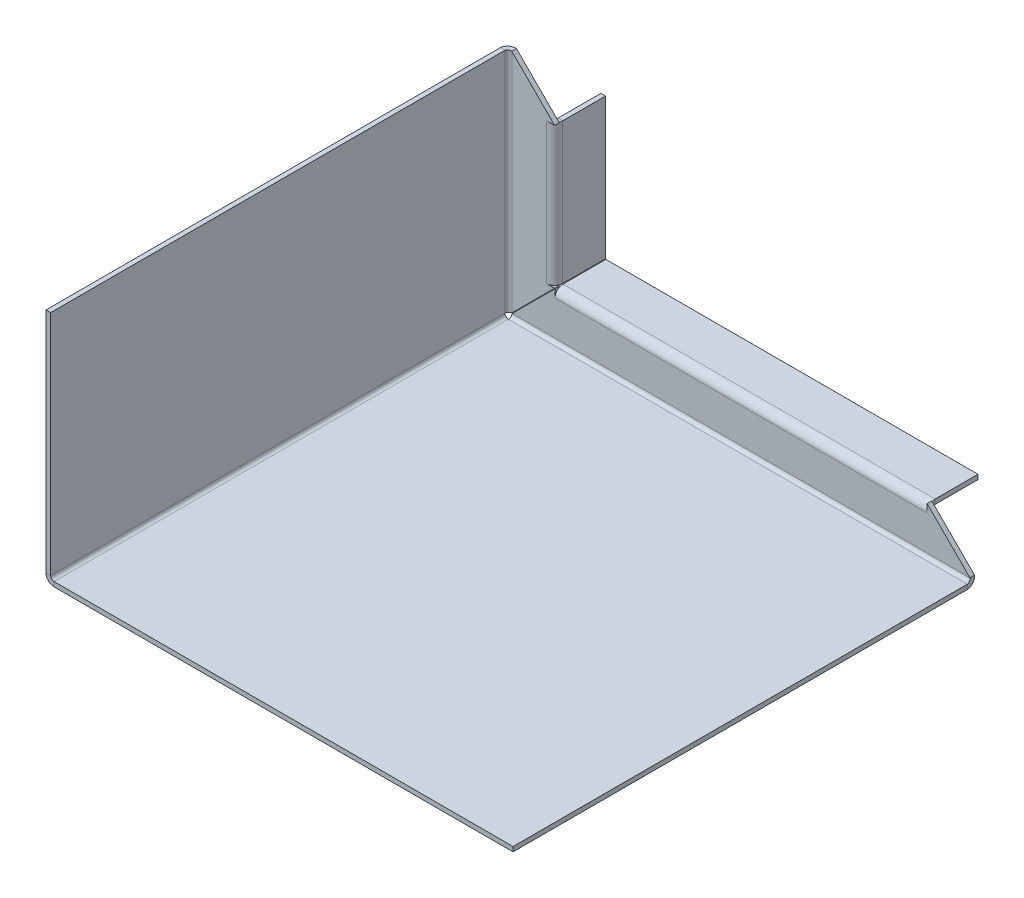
ISO-10303-21;
HEADER;
FILE_DESCRIPTION(('STEP AP214'),'2;1');
FILE_NAME('part.step','',(''),(''),'','','');
FILE_SCHEMA(('AUTOMOTIVE_DESIGN { 1 0 10303 214 1 1 1 1 }'));
ENDSEC;
DATA;
#1=APPLICATION_CONTEXT('core data for automotive mechanical design processes');
#2=APPLICATION_PROTOCOL_DEFINITION('international standard','automotive_design',2000,#1);
#3=PRODUCT_CONTEXT('',#1,'mechanical');
#4=PRODUCT('Part','Part','',(#3));
#5=PRODUCT_RELATED_PRODUCT_CATEGORY('part','',(#4));
#6=PRODUCT_DEFINITION_FORMATION('','',#4);
#7=PRODUCT_DEFINITION_CONTEXT('part definition',#1,'design');
#8=PRODUCT_DEFINITION('design','',#6,#7);
#9=PRODUCT_DEFINITION_SHAPE('','',#8);
#10=(LENGTH_UNIT() NAMED_UNIT(*) SI_UNIT(.MILLI.,.METRE.));
#11=(NAMED_UNIT(*) PLANE_ANGLE_UNIT() SI_UNIT($,.RADIAN.));
#12=(NAMED_UNIT(*) SI_UNIT($,.STERADIAN.) SOLID_ANGLE_UNIT());
#13=UNCERTAINTY_MEASURE_WITH_UNIT(LENGTH_MEASURE(1.E-05),#10,'distance_accuracy_value','');
#14=(GEOMETRIC_REPRESENTATION_CONTEXT(3) GLOBAL_UNCERTAINTY_ASSIGNED_CONTEXT((#13)) GLOBAL_UNIT_ASSIGNED_CONTEXT((#10,
#11,#12)) REPRESENTATION_CONTEXT('',''));
#15=CARTESIAN_POINT('',(0.,0.,0.));
#16=DIRECTION('',(0.,0.,1.));
#17=DIRECTION('',(1.,0.,0.));
#18=AXIS2_PLACEMENT_3D('',#15,#16,#17);
#19=CARTESIAN_POINT('',(90.5598233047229,10.,-1.38474301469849E-12));
#20=DIRECTION('',(-1.,0.,0.));
#21=DIRECTION('',(0.,0.,1.));
#22=AXIS2_PLACEMENT_3D('',#19,#20,#21);
#23=PLANE('',#22);
#24=DIRECTION('',(0.,-1.,0.));
#25=VECTOR('',#24,1.);
#26=CARTESIAN_POINT('',(90.5598233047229,10.,-1.38474301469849E-12));
#27=LINE('',#26,#25);
#28=CARTESIAN_POINT('',(90.5598233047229,10.,-1.38474301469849E-12));
#29=VERTEX_POINT('',#28);
#30=CARTESIAN_POINT('',(90.5598233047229,9.83604109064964,-1.39002497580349E-12));
#31=VERTEX_POINT('',#30);
#32=EDGE_CURVE('E423',#29,#31,#27,.T.);
#33=ORIENTED_EDGE('',*,*,#32,.T.);
#34=CARTESIAN_POINT('',(90.5598233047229,8.26339999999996,-0.736600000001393));
#35=DIRECTION('',(1.,0.,0.));
#36=DIRECTION('',(0.,0.,-1.));
#37=AXIS2_PLACEMENT_3D('',#34,#35,#36);
#38=CIRCLE('',#37,1.73659999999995);
#39=CARTESIAN_POINT('',(90.5598233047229,8.2634,0.999999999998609));
#40=VERTEX_POINT('',#39);
#41=EDGE_CURVE('E13',#31,#40,#38,.T.);
#42=ORIENTED_EDGE('',*,*,#41,.T.);
#43=DIRECTION('',(0.,-1.,0.));
#44=VECTOR('',#43,1.);
#45=CARTESIAN_POINT('',(90.5598233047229,9.99999999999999,0.999999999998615));
#46=LINE('',#45,#44);
#47=CARTESIAN_POINT('',(90.5598233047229,9.99999999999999,0.999999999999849));
#48=VERTEX_POINT('',#47);
#49=EDGE_CURVE('E431',#48,#40,#46,.T.);
#50=ORIENTED_EDGE('',*,*,#49,.F.);
#51=DIRECTION('',(0.,0.,1.));
#52=VECTOR('',#51,1.);
#53=CARTESIAN_POINT('',(90.5598233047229,9.99999999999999,0.999999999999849));
#54=LINE('',#53,#52);
#55=EDGE_CURVE('E451',#48,#29,#54,.F.);
#56=ORIENTED_EDGE('',*,*,#55,.T.);
#57=EDGE_LOOP('',(#33,#42,#50,#56));
#58=FACE_BOUND('',#57,.T.);
#59=ADVANCED_FACE('F112',(#58),#23,.T.);
#60=CARTESIAN_POINT('',(10.0707106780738,8.2634000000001,-1.67075554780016E-13));
#61=DIRECTION('',(1.,0.,0.));
#62=DIRECTION('',(0.,1.,0.));
#63=AXIS2_PLACEMENT_3D('',#60,#61,#62);
#64=PLANE('',#63);
#65=DIRECTION('',(0.,1.,0.));
#66=VECTOR('',#65,1.);
#67=CARTESIAN_POINT('',(10.0707106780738,9.99999999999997,0.999999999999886));
#68=LINE('',#67,#66);
#69=CARTESIAN_POINT('',(10.0707106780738,8.2634000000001,0.99999999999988));
#70=VERTEX_POINT('',#69);
#71=CARTESIAN_POINT('',(10.0707106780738,10.,0.999999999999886));
#72=VERTEX_POINT('',#71);
#73=EDGE_CURVE('E425',#70,#72,#68,.T.);
#74=ORIENTED_EDGE('',*,*,#73,.F.);
#75=CARTESIAN_POINT('',(10.0707106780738,8.26340000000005,-0.736600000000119));
#76=DIRECTION('',(1.,0.,0.));
#77=DIRECTION('',(0.,0.,-1.));
#78=AXIS2_PLACEMENT_3D('',#75,#76,#77);
#79=CIRCLE('',#78,1.73659999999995);
#80=CARTESIAN_POINT('',(10.0707106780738,9.83604109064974,-1.19063647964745E-13));
#81=VERTEX_POINT('',#80);
#82=EDGE_CURVE('E359',#70,#81,#79,.F.);
#83=ORIENTED_EDGE('',*,*,#82,.T.);
#84=DIRECTION('',(0.,1.,0.));
#85=VECTOR('',#84,1.);
#86=CARTESIAN_POINT('',(10.0707106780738,8.2634000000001,-1.67075554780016E-13));
#87=LINE('',#86,#85);
#88=CARTESIAN_POINT('',(10.0707106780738,10.,-1.14058068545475E-13));
#89=VERTEX_POINT('',#88);
#90=EDGE_CURVE('E412',#81,#89,#87,.T.);
#91=ORIENTED_EDGE('',*,*,#90,.T.);
#92=DIRECTION('',(0.,0.,1.));
#93=VECTOR('',#92,1.);
#94=CARTESIAN_POINT('',(10.0707106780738,10.,-1.14058068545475E-13));
#95=LINE('',#94,#93);
#96=EDGE_CURVE('E447',#89,#72,#95,.T.);
#97=ORIENTED_EDGE('',*,*,#96,.T.);
#98=EDGE_LOOP('',(#74,#83,#91,#97));
#99=FACE_BOUND('',#98,.T.);
#100=ADVANCED_FACE('F858',(#99),#64,.T.);
#101=CARTESIAN_POINT('',(9.99999999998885,10.0707106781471,2.35271871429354E-13));
#102=DIRECTION('',(0.,1.,0.));
#103=DIRECTION('',(-1.,0.,0.));
#104=AXIS2_PLACEMENT_3D('',#101,#102,#103);
#105=PLANE('',#104);
#106=DIRECTION('',(-1.,0.,0.));
#107=VECTOR('',#106,1.);
#108=CARTESIAN_POINT('',(9.99999999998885,10.0707106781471,2.35271871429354E-13));
#109=LINE('',#108,#107);
#110=CARTESIAN_POINT('',(9.99999999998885,10.0707106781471,2.35271871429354E-13));
#111=VERTEX_POINT('',#110);
#112=CARTESIAN_POINT('',(9.83604109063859,10.0707106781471,2.35046671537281E-13));
#113=VERTEX_POINT('',#112);
#114=EDGE_CURVE('E435',#111,#113,#109,.T.);
#115=ORIENTED_EDGE('',*,*,#114,.T.);
#116=CARTESIAN_POINT('',(8.26339999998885,10.0707106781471,-0.736599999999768));
#117=DIRECTION('',(0.,-1.,0.));
#118=DIRECTION('',(0.,0.,-1.));
#119=AXIS2_PLACEMENT_3D('',#116,#117,#118);
#120=CIRCLE('',#119,1.7366);
#121=CARTESIAN_POINT('',(8.26339999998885,10.0707106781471,1.00000000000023));
#122=VERTEX_POINT('',#121);
#123=EDGE_CURVE('E123',#113,#122,#120,.T.);
#124=ORIENTED_EDGE('',*,*,#123,.T.);
#125=DIRECTION('',(-1.,0.,0.));
#126=VECTOR('',#125,1.);
#127=CARTESIAN_POINT('',(9.9999999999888,10.0707106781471,1.00000000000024));
#128=LINE('',#127,#126);
#129=CARTESIAN_POINT('',(9.99999999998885,10.0707106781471,1.00000000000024));
#130=VERTEX_POINT('',#129);
#131=EDGE_CURVE('E443',#130,#122,#128,.T.);
#132=ORIENTED_EDGE('',*,*,#131,.F.);
#133=DIRECTION('',(0.,0.,1.));
#134=VECTOR('',#133,1.);
#135=CARTESIAN_POINT('',(9.99999999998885,10.0707106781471,2.35271871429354E-13));
#136=LINE('',#135,#134);
#137=EDGE_CURVE('E574',#111,#130,#136,.T.);
#138=ORIENTED_EDGE('',*,*,#137,.F.);
#139=EDGE_LOOP('',(#115,#124,#132,#138));
#140=FACE_BOUND('',#139,.T.);
#141=ADVANCED_FACE('F864',(#140),#105,.T.);
#142=CARTESIAN_POINT('',(8.26339999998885,40.5598233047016,2.30609802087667E-13));
#143=DIRECTION('',(0.,-1.,0.));
#144=DIRECTION('',(0.,0.,-1.));
#145=AXIS2_PLACEMENT_3D('',#142,#143,#144);
#146=PLANE('',#145);
#147=DIRECTION('',(1.,0.,0.));
#148=VECTOR('',#147,1.);
#149=CARTESIAN_POINT('',(9.99999999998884,40.5598233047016,1.00000000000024));
#150=LINE('',#149,#148);
#151=CARTESIAN_POINT('',(8.26339999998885,40.5598233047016,1.00000000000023));
#152=VERTEX_POINT('',#151);
#153=CARTESIAN_POINT('',(9.99999999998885,40.5598233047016,1.00000000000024));
#154=VERTEX_POINT('',#153);
#155=EDGE_CURVE('E437',#152,#154,#150,.T.);
#156=ORIENTED_EDGE('',*,*,#155,.F.);
#157=CARTESIAN_POINT('',(8.26339999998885,40.5598233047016,-0.73659999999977));
#158=DIRECTION('',(0.,-1.,0.));
#159=DIRECTION('',(0.,0.,-1.));
#160=AXIS2_PLACEMENT_3D('',#157,#158,#159);
#161=CIRCLE('',#160,1.7366);
#162=CARTESIAN_POINT('',(9.83604109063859,40.5598233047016,2.34831708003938E-13));
#163=VERTEX_POINT('',#162);
#164=EDGE_CURVE('E409',#152,#163,#161,.F.);
#165=ORIENTED_EDGE('',*,*,#164,.T.);
#166=DIRECTION('',(1.,0.,0.));
#167=VECTOR('',#166,1.);
#168=CARTESIAN_POINT('',(8.26339999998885,40.5598233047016,2.30609802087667E-13));
#169=LINE('',#168,#167);
#170=CARTESIAN_POINT('',(9.99999999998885,40.5598233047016,2.35271871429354E-13));
#171=VERTEX_POINT('',#170);
#172=EDGE_CURVE('E434',#163,#171,#169,.T.);
#173=ORIENTED_EDGE('',*,*,#172,.T.);
#174=DIRECTION('',(0.,0.,1.));
#175=VECTOR('',#174,1.);
#176=CARTESIAN_POINT('',(9.99999999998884,40.5598233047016,1.00000000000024));
#177=LINE('',#176,#175);
#178=EDGE_CURVE('E564',#154,#171,#177,.F.);
#179=ORIENTED_EDGE('',*,*,#178,.F.);
#180=EDGE_LOOP('',(#156,#165,#173,#179));
#181=FACE_BOUND('',#180,.T.);
#182=ADVANCED_FACE('F855',(#181),#146,.T.);
#183=CARTESIAN_POINT('',(0.736600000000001,9.99999999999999,1.00000000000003));
#184=DIRECTION('',(0.,0.,1.));
#185=DIRECTION('',(0.,1.,0.));
#186=AXIS2_PLACEMENT_3D('',#183,#184,#185);
#187=PLANE('',#186);
#188=DIRECTION('',(0.707106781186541,-0.707106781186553,0.));
#189=VECTOR('',#188,1.);
#190=CARTESIAN_POINT('',(90.5598233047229,9.99999999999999,0.999999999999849));
#191=LINE('',#190,#189);
#192=CARTESIAN_POINT('',(99.8232233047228,0.736599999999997,0.999999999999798));
#193=VERTEX_POINT('',#192);
#194=EDGE_CURVE('E815',#48,#193,#191,.T.);
#195=ORIENTED_EDGE('',*,*,#194,.F.);
#196=ORIENTED_EDGE('',*,*,#49,.T.);
#197=DIRECTION('',(1.,0.,0.));
#198=VECTOR('',#197,1.);
#199=CARTESIAN_POINT('',(90.5598233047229,8.26340000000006,0.999999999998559));
#200=LINE('',#199,#198);
#201=EDGE_CURVE('E356',#40,#70,#200,.F.);
#202=ORIENTED_EDGE('',*,*,#201,.T.);
#203=ORIENTED_EDGE('',*,*,#73,.T.);
#204=DIRECTION('',(-0.707106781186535,-0.70710678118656,0.));
#205=VECTOR('',#204,1.);
#206=CARTESIAN_POINT('',(5.40365533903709,5.33294466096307,0.999999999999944));
#207=LINE('',#206,#205);
#208=CARTESIAN_POINT('',(0.807310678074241,0.736600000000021,1.00000000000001));
#209=VERTEX_POINT('',#208);
#210=EDGE_CURVE('E812',#72,#209,#207,.T.);
#211=ORIENTED_EDGE('',*,*,#210,.T.);
#212=DIRECTION('',(1.,0.,0.));
#213=VECTOR('',#212,1.);
#214=CARTESIAN_POINT('',(0.7366,0.736599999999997,1.));
#215=LINE('',#214,#213);
#216=EDGE_CURVE('E450',#209,#193,#215,.T.);
#217=ORIENTED_EDGE('',*,*,#216,.T.);
#218=EDGE_LOOP('',(#195,#196,#202,#203,#211,#217));
#219=FACE_BOUND('',#218,.T.);
#220=ADVANCED_FACE('F845',(#219),#187,.T.);
#221=CARTESIAN_POINT('',(0.736599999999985,10.,0.));
#222=DIRECTION('',(0.,0.,1.));
#223=DIRECTION('',(0.,1.,0.));
#224=AXIS2_PLACEMENT_3D('',#221,#222,#223);
#225=PLANE('',#224);
#226=ORIENTED_EDGE('',*,*,#32,.F.);
#227=DIRECTION('',(0.707106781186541,-0.707106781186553,0.));
#228=VECTOR('',#227,1.);
#229=CARTESIAN_POINT('',(90.5598233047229,10.,-1.51137782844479E-13));
#230=LINE('',#229,#228);
#231=CARTESIAN_POINT('',(99.8232233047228,0.736599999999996,-1.56255217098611E-12));
#232=VERTEX_POINT('',#231);
#233=EDGE_CURVE('E1486',#29,#232,#230,.T.);
#234=ORIENTED_EDGE('',*,*,#233,.T.);
#235=DIRECTION('',(1.,0.,0.));
#236=VECTOR('',#235,1.);
#237=CARTESIAN_POINT('',(0.736599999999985,0.736600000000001,0.));
#238=LINE('',#237,#236);
#239=CARTESIAN_POINT('',(0.807310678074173,0.736599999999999,0.));
#240=VERTEX_POINT('',#239);
#241=EDGE_CURVE('E446',#240,#232,#238,.T.);
#242=ORIENTED_EDGE('',*,*,#241,.F.);
#243=DIRECTION('',(-0.707106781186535,-0.70710678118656,0.));
#244=VECTOR('',#243,1.);
#245=CARTESIAN_POINT('',(5.40365533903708,5.33294466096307,0.));
#246=LINE('',#245,#244);
#247=EDGE_CURVE('E1485',#89,#240,#246,.T.);
#248=ORIENTED_EDGE('',*,*,#247,.F.);
#249=ORIENTED_EDGE('',*,*,#90,.F.);
#250=CARTESIAN_POINT('',(10.0707106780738,8.2634000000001,-1.20076517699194E-13));
#251=VERTEX_POINT('',#250);
#252=EDGE_CURVE('E426',#251,#81,#87,.T.);
#253=ORIENTED_EDGE('',*,*,#252,.F.);
#254=DIRECTION('',(1.,0.,0.));
#255=VECTOR('',#254,1.);
#256=CARTESIAN_POINT('',(90.5598233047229,8.2634,-1.44068784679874E-12));
#257=LINE('',#256,#255);
#258=CARTESIAN_POINT('',(90.5598233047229,8.2634,-1.39072990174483E-12));
#259=VERTEX_POINT('',#258);
#260=EDGE_CURVE('E367',#259,#251,#257,.F.);
#261=ORIENTED_EDGE('',*,*,#260,.F.);
#262=EDGE_CURVE('E132',#31,#259,#27,.T.);
#263=ORIENTED_EDGE('',*,*,#262,.F.);
#264=EDGE_LOOP('',(#226,#234,#242,#248,#249,#253,#261,#263));
#265=FACE_BOUND('',#264,.T.);
#266=ADVANCED_FACE('F847',(#265),#225,.F.);
#267=CARTESIAN_POINT('',(9.99999999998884,50.,1.00000000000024));
#268=DIRECTION('',(0.,0.,1.));
#269=DIRECTION('',(1.,0.,0.));
#270=AXIS2_PLACEMENT_3D('',#267,#268,#269);
#271=PLANE('',#270);
#272=DIRECTION('',(0.707106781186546,0.707106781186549,0.));
#273=VECTOR('',#272,1.);
#274=CARTESIAN_POINT('',(29.9646446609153,30.0353553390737,1.0000000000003));
#275=LINE('',#274,#273);
#276=CARTESIAN_POINT('',(0.736599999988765,0.807310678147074,1.0000000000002));
#277=VERTEX_POINT('',#276);
#278=EDGE_CURVE('E1522',#277,#130,#275,.T.);
#279=ORIENTED_EDGE('',*,*,#278,.T.);
#280=ORIENTED_EDGE('',*,*,#131,.T.);
#281=DIRECTION('',(0.,-1.,0.));
#282=VECTOR('',#281,1.);
#283=CARTESIAN_POINT('',(8.26339999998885,10.0707106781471,1.00000000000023));
#284=LINE('',#283,#282);
#285=EDGE_CURVE('E404',#122,#152,#284,.F.);
#286=ORIENTED_EDGE('',*,*,#285,.T.);
#287=ORIENTED_EDGE('',*,*,#155,.T.);
#288=DIRECTION('',(0.707106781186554,-0.707106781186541,0.));
#289=VECTOR('',#288,1.);
#290=CARTESIAN_POINT('',(0.736599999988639,49.8232233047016,1.00000000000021));
#291=LINE('',#290,#289);
#292=CARTESIAN_POINT('',(0.736599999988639,49.8232233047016,1.00000000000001));
#293=VERTEX_POINT('',#292);
#294=EDGE_CURVE('E573',#293,#154,#291,.T.);
#295=ORIENTED_EDGE('',*,*,#294,.F.);
#296=DIRECTION('',(0.,-1.,0.));
#297=VECTOR('',#296,1.);
#298=CARTESIAN_POINT('',(0.736599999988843,50.,1.0000000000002));
#299=LINE('',#298,#297);
#300=EDGE_CURVE('E1393',#293,#277,#299,.T.);
#301=ORIENTED_EDGE('',*,*,#300,.T.);
#302=EDGE_LOOP('',(#279,#280,#286,#287,#295,#301));
#303=FACE_BOUND('',#302,.T.);
#304=ADVANCED_FACE('F535',(#303),#271,.T.);
#305=CARTESIAN_POINT('',(9.99999999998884,50.,2.35488711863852E-13));
#306=DIRECTION('',(0.,0.,1.));
#307=DIRECTION('',(1.,0.,0.));
#308=AXIS2_PLACEMENT_3D('',#305,#306,#307);
#309=PLANE('',#308);
#310=ORIENTED_EDGE('',*,*,#114,.F.);
#311=DIRECTION('',(0.707106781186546,0.707106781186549,0.));
#312=VECTOR('',#311,1.);
#313=CARTESIAN_POINT('',(29.9646446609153,30.0353553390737,3.03359767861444E-13));
#314=LINE('',#313,#312);
#315=CARTESIAN_POINT('',(0.736599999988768,0.807310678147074,2.04009107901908E-13));
#316=VERTEX_POINT('',#315);
#317=EDGE_CURVE('E578',#316,#111,#314,.T.);
#318=ORIENTED_EDGE('',*,*,#317,.F.);
#319=DIRECTION('',(0.,-1.,0.));
#320=VECTOR('',#319,1.);
#321=CARTESIAN_POINT('',(0.736599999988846,50.,2.03830008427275E-13));
#322=LINE('',#321,#320);
#323=CARTESIAN_POINT('',(0.736599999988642,49.8232233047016,2.03613167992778E-13));
#324=VERTEX_POINT('',#323);
#325=EDGE_CURVE('E1421',#324,#316,#322,.T.);
#326=ORIENTED_EDGE('',*,*,#325,.F.);
#327=DIRECTION('',(0.707106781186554,-0.707106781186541,0.));
#328=VECTOR('',#327,1.);
#329=CARTESIAN_POINT('',(0.736599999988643,49.8232233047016,2.06648934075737E-13));
#330=LINE('',#329,#328);
#331=EDGE_CURVE('E577',#324,#171,#330,.T.);
#332=ORIENTED_EDGE('',*,*,#331,.T.);
#333=ORIENTED_EDGE('',*,*,#172,.F.);
#334=CARTESIAN_POINT('',(8.26339999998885,40.5598233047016,2.30609802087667E-13));
#335=VERTEX_POINT('',#334);
#336=EDGE_CURVE('E438',#335,#163,#169,.T.);
#337=ORIENTED_EDGE('',*,*,#336,.F.);
#338=DIRECTION('',(0.,-1.,0.));
#339=VECTOR('',#338,1.);
#340=CARTESIAN_POINT('',(8.26339999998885,10.0707106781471,2.32886626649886E-13));
#341=LINE('',#340,#339);
#342=CARTESIAN_POINT('',(8.26339999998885,10.0707106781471,2.32886626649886E-13));
#343=VERTEX_POINT('',#342);
#344=EDGE_CURVE('E418',#343,#335,#341,.F.);
#345=ORIENTED_EDGE('',*,*,#344,.F.);
#346=EDGE_CURVE('E140',#113,#343,#109,.T.);
#347=ORIENTED_EDGE('',*,*,#346,.F.);
#348=EDGE_LOOP('',(#310,#318,#326,#332,#333,#337,#345,#347));
#349=FACE_BOUND('',#348,.T.);
#350=ADVANCED_FACE('F853',(#349),#309,.F.);
#351=CARTESIAN_POINT('',(-1.13652339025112E-11,50.,100.));
#352=DIRECTION('',(1.,0.,0.));
#353=DIRECTION('',(0.,1.,0.));
#354=AXIS2_PLACEMENT_3D('',#351,#352,#353);
#355=PLANE('',#354);
#356=DIRECTION('',(0.,0.,-1.));
#357=VECTOR('',#356,1.);
#358=CARTESIAN_POINT('',(-1.13644027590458E-11,0.736600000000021,100.));
#359=LINE('',#358,#357);
#360=CARTESIAN_POINT('',(0.,0.736599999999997,100.));
#361=VERTEX_POINT('',#360);
#362=CARTESIAN_POINT('',(-5.68230633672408E-12,0.736599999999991,1.73660000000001));
#363=VERTEX_POINT('',#362);
#364=EDGE_CURVE('E739',#361,#363,#359,.T.);
#365=ORIENTED_EDGE('',*,*,#364,.T.);
#366=DIRECTION('',(0.,-1.,0.));
#367=VECTOR('',#366,1.);
#368=CARTESIAN_POINT('',(-1.13738228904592E-11,546.317000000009,1.73660000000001));
#369=LINE('',#368,#367);
#370=CARTESIAN_POINT('',(-1.1365474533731E-11,50.,1.73660000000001));
#371=VERTEX_POINT('',#370);
#372=EDGE_CURVE('E740',#371,#363,#369,.T.);
#373=ORIENTED_EDGE('',*,*,#372,.F.);
#374=DIRECTION('',(0.,0.,-1.));
#375=VECTOR('',#374,1.);
#376=CARTESIAN_POINT('',(-1.13652339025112E-11,50.,100.));
#377=LINE('',#376,#375);
#378=CARTESIAN_POINT('',(-1.13652339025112E-11,50.,100.));
#379=VERTEX_POINT('',#378);
#380=EDGE_CURVE('E744',#379,#371,#377,.T.);
#381=ORIENTED_EDGE('',*,*,#380,.F.);
#382=DIRECTION('',(0.,-1.,0.));
#383=VECTOR('',#382,1.);
#384=CARTESIAN_POINT('',(-1.13652339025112E-11,50.,100.));
#385=LINE('',#384,#383);
#386=EDGE_CURVE('E725',#379,#361,#385,.T.);
#387=ORIENTED_EDGE('',*,*,#386,.T.);
#388=EDGE_LOOP('',(#365,#373,#381,#387));
#389=FACE_BOUND('',#388,.T.);
#390=ADVANCED_FACE('F114',(#389),#355,.T.);
#391=CARTESIAN_POINT('',(-1.00000000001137,50.,100.));
#392=DIRECTION('',(0.,1.,0.));
#393=DIRECTION('',(0.,0.,1.));
#394=AXIS2_PLACEMENT_3D('',#391,#392,#393);
#395=PLANE('',#394);
#396=ORIENTED_EDGE('',*,*,#380,.T.);
#397=CARTESIAN_POINT('',(-1.00000000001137,50.,1.73660000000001));
#398=CARTESIAN_POINT('',(-1.1365474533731E-11,50.,1.73660000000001));
#399=B_SPLINE_CURVE_WITH_KNOTS('',1,(#397,#398),.UNSPECIFIED.,.F.,.F.,(2,2),(0.,1.),.UNSPECIFIED.);
#400=CARTESIAN_POINT('',(-1.00000000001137,50.,1.73660000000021));
#401=VERTEX_POINT('',#400);
#402=EDGE_CURVE('E753',#401,#371,#399,.T.);
#403=ORIENTED_EDGE('',*,*,#402,.F.);
#404=DIRECTION('',(0.,0.,-1.));
#405=VECTOR('',#404,1.);
#406=CARTESIAN_POINT('',(-1.00000000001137,50.,100.));
#407=LINE('',#406,#405);
#408=CARTESIAN_POINT('',(-1.00000000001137,50.,100.));
#409=VERTEX_POINT('',#408);
#410=EDGE_CURVE('E734',#409,#401,#407,.T.);
#411=ORIENTED_EDGE('',*,*,#410,.F.);
#412=DIRECTION('',(1.,0.,0.));
#413=VECTOR('',#412,1.);
#414=CARTESIAN_POINT('',(-1.00000000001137,50.,100.));
#415=LINE('',#414,#413);
#416=EDGE_CURVE('E728',#409,#379,#415,.T.);
#417=ORIENTED_EDGE('',*,*,#416,.T.);
#418=EDGE_LOOP('',(#396,#403,#411,#417));
#419=FACE_BOUND('',#418,.T.);
#420=ADVANCED_FACE('F759',(#419),#395,.T.);
#421=CARTESIAN_POINT('',(-1.00000000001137,50.,100.));
#422=DIRECTION('',(1.,0.,0.));
#423=DIRECTION('',(0.,1.,0.));
#424=AXIS2_PLACEMENT_3D('',#421,#422,#423);
#425=PLANE('',#424);
#426=DIRECTION('',(0.,-1.,0.));
#427=VECTOR('',#426,1.);
#428=CARTESIAN_POINT('',(-1.00000000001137,546.317000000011,1.73660000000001));
#429=LINE('',#428,#427);
#430=CARTESIAN_POINT('',(-1.00000000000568,0.736599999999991,1.73660000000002));
#431=VERTEX_POINT('',#430);
#432=EDGE_CURVE('E757',#401,#431,#429,.T.);
#433=ORIENTED_EDGE('',*,*,#432,.T.);
#434=DIRECTION('',(0.,0.,-1.));
#435=VECTOR('',#434,1.);
#436=CARTESIAN_POINT('',(-1.00000000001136,0.73660000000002,100.));
#437=LINE('',#436,#435);
#438=CARTESIAN_POINT('',(-1.,0.736599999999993,100.));
#439=VERTEX_POINT('',#438);
#440=EDGE_CURVE('E738',#439,#431,#437,.T.);
#441=ORIENTED_EDGE('',*,*,#440,.F.);
#442=DIRECTION('',(0.,-1.,0.));
#443=VECTOR('',#442,1.);
#444=CARTESIAN_POINT('',(-1.00000000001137,50.,100.));
#445=LINE('',#444,#443);
#446=EDGE_CURVE('E731',#409,#439,#445,.T.);
#447=ORIENTED_EDGE('',*,*,#446,.F.);
#448=ORIENTED_EDGE('',*,*,#410,.T.);
#449=EDGE_LOOP('',(#433,#441,#447,#448));
#450=FACE_BOUND('',#449,.T.);
#451=ADVANCED_FACE('F768',(#450),#425,.F.);
#452=CARTESIAN_POINT('',(0.736599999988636,0.736600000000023,100.));
#453=DIRECTION('',(0.,0.,-1.));
#454=DIRECTION('',(-1.,0.,0.));
#455=AXIS2_PLACEMENT_3D('',#452,#453,#454);
#456=PLANE('',#455);
#457=ORIENTED_EDGE('',*,*,#446,.T.);
#458=DIRECTION('',(1.,0.,0.));
#459=VECTOR('',#458,1.);
#460=CARTESIAN_POINT('',(-1.00000000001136,0.73660000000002,100.));
#461=LINE('',#460,#459);
#462=EDGE_CURVE('E735',#439,#361,#461,.T.);
#463=ORIENTED_EDGE('',*,*,#462,.T.);
#464=ORIENTED_EDGE('',*,*,#386,.F.);
#465=ORIENTED_EDGE('',*,*,#416,.F.);
#466=EDGE_LOOP('',(#457,#463,#464,#465));
#467=FACE_BOUND('',#466,.T.);
#468=ADVANCED_FACE('F771',(#467),#456,.F.);
#469=CARTESIAN_POINT('',(100.,0.,100.));
#470=DIRECTION('',(1.,0.,0.));
#471=DIRECTION('',(0.,0.,-1.));
#472=AXIS2_PLACEMENT_3D('',#469,#470,#471);
#473=PLANE('',#472);
#474=DIRECTION('',(0.,0.,-1.));
#475=VECTOR('',#474,1.);
#476=CARTESIAN_POINT('',(100.,-1.,100.));
#477=LINE('',#476,#475);
#478=CARTESIAN_POINT('',(100.,-1.,100.));
#479=VERTEX_POINT('',#478);
#480=CARTESIAN_POINT('',(99.9999999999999,-1.00000000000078,1.73660000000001));
#481=VERTEX_POINT('',#480);
#482=EDGE_CURVE('E716',#479,#481,#477,.T.);
#483=ORIENTED_EDGE('',*,*,#482,.T.);
#484=CARTESIAN_POINT('',(99.9999999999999,-1.56732266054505E-12,1.73660000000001));
#485=CARTESIAN_POINT('',(99.9999999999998,-1.00000000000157,1.73660000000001));
#486=B_SPLINE_CURVE_WITH_KNOTS('',1,(#484,#485),.UNSPECIFIED.,.F.,.F.,(2,2),(0.,1.),.UNSPECIFIED.);
#487=CARTESIAN_POINT('',(99.9999999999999,-2.05722044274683E-13,1.73660000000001));
#488=VERTEX_POINT('',#487);
#489=EDGE_CURVE('E1425',#481,#488,#486,.F.);
#490=ORIENTED_EDGE('',*,*,#489,.T.);
#491=DIRECTION('',(0.,0.,-1.));
#492=VECTOR('',#491,1.);
#493=CARTESIAN_POINT('',(100.,0.,100.));
#494=LINE('',#493,#492);
#495=CARTESIAN_POINT('',(100.,0.,100.));
#496=VERTEX_POINT('',#495);
#497=EDGE_CURVE('E712',#496,#488,#494,.T.);
#498=ORIENTED_EDGE('',*,*,#497,.F.);
#499=DIRECTION('',(0.,-1.,0.));
#500=VECTOR('',#499,1.);
#501=CARTESIAN_POINT('',(100.,0.,100.));
#502=LINE('',#501,#500);
#503=EDGE_CURVE('E713',#496,#479,#502,.T.);
#504=ORIENTED_EDGE('',*,*,#503,.T.);
#505=EDGE_LOOP('',(#483,#490,#498,#504));
#506=FACE_BOUND('',#505,.T.);
#507=ADVANCED_FACE('F775',(#506),#473,.T.);
#508=CARTESIAN_POINT('',(0.,0.,100.));
#509=DIRECTION('',(0.,1.,0.));
#510=DIRECTION('',(0.,0.,1.));
#511=AXIS2_PLACEMENT_3D('',#508,#509,#510);
#512=PLANE('',#511);
#513=ORIENTED_EDGE('',*,*,#497,.T.);
#514=DIRECTION('',(1.,0.,0.));
#515=VECTOR('',#514,1.);
#516=CARTESIAN_POINT('',(0.736599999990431,0.,1.73660000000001));
#517=LINE('',#516,#515);
#518=CARTESIAN_POINT('',(0.736599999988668,0.,1.73660000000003));
#519=VERTEX_POINT('',#518);
#520=EDGE_CURVE('E1424',#519,#488,#517,.T.);
#521=ORIENTED_EDGE('',*,*,#520,.F.);
#522=DIRECTION('',(0.,0.,-1.));
#523=VECTOR('',#522,1.);
#524=CARTESIAN_POINT('',(0.7366,0.,100.));
#525=LINE('',#524,#523);
#526=CARTESIAN_POINT('',(0.736599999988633,0.,100.));
#527=VERTEX_POINT('',#526);
#528=EDGE_CURVE('E719',#527,#519,#525,.T.);
#529=ORIENTED_EDGE('',*,*,#528,.F.);
#530=DIRECTION('',(1.,0.,0.));
#531=VECTOR('',#530,1.);
#532=CARTESIAN_POINT('',(0.,0.,100.));
#533=LINE('',#532,#531);
#534=EDGE_CURVE('E709',#527,#496,#533,.T.);
#535=ORIENTED_EDGE('',*,*,#534,.T.);
#536=EDGE_LOOP('',(#513,#521,#529,#535));
#537=FACE_BOUND('',#536,.T.);
#538=ADVANCED_FACE('F785',(#537),#512,.T.);
#539=CARTESIAN_POINT('',(-1.,0.736599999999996,100.));
#540=DIRECTION('',(0.,0.,1.));
#541=DIRECTION('',(1.,0.,0.));
#542=AXIS2_PLACEMENT_3D('',#539,#540,#541);
#543=PLANE('',#542);
#544=ORIENTED_EDGE('',*,*,#534,.F.);
#545=DIRECTION('',(0.,-1.,0.));
#546=VECTOR('',#545,1.);
#547=CARTESIAN_POINT('',(0.7366,0.,100.));
#548=LINE('',#547,#546);
#549=CARTESIAN_POINT('',(0.7366,-1.,100.));
#550=VERTEX_POINT('',#549);
#551=EDGE_CURVE('E706',#527,#550,#548,.T.);
#552=ORIENTED_EDGE('',*,*,#551,.T.);
#553=DIRECTION('',(1.,0.,0.));
#554=VECTOR('',#553,1.);
#555=CARTESIAN_POINT('',(0.,-1.,100.));
#556=LINE('',#555,#554);
#557=EDGE_CURVE('E703',#550,#479,#556,.T.);
#558=ORIENTED_EDGE('',*,*,#557,.T.);
#559=ORIENTED_EDGE('',*,*,#503,.F.);
#560=EDGE_LOOP('',(#544,#552,#558,#559));
#561=FACE_BOUND('',#560,.T.);
#562=ADVANCED_FACE('F781',(#561),#543,.T.);
#563=CARTESIAN_POINT('',(0.,-1.,100.));
#564=DIRECTION('',(0.,1.,0.));
#565=DIRECTION('',(0.,0.,1.));
#566=AXIS2_PLACEMENT_3D('',#563,#564,#565);
#567=PLANE('',#566);
#568=DIRECTION('',(1.,0.,0.));
#569=VECTOR('',#568,1.);
#570=CARTESIAN_POINT('',(0.736599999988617,-1.,1.73660000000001));
#571=LINE('',#570,#569);
#572=CARTESIAN_POINT('',(0.736599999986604,-1.,1.73660000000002));
#573=VERTEX_POINT('',#572);
#574=EDGE_CURVE('E1428',#573,#481,#571,.T.);
#575=ORIENTED_EDGE('',*,*,#574,.T.);
#576=ORIENTED_EDGE('',*,*,#482,.F.);
#577=ORIENTED_EDGE('',*,*,#557,.F.);
#578=DIRECTION('',(0.,0.,-1.));
#579=VECTOR('',#578,1.);
#580=CARTESIAN_POINT('',(0.7366,-1.,100.));
#581=LINE('',#580,#579);
#582=EDGE_CURVE('E705',#550,#573,#581,.T.);
#583=ORIENTED_EDGE('',*,*,#582,.T.);
#584=EDGE_LOOP('',(#575,#576,#577,#583));
#585=FACE_BOUND('',#584,.T.);
#586=ADVANCED_FACE('F777',(#585),#567,.F.);
#587=CARTESIAN_POINT('',(0.7366,0.7366,100.));
#588=DIRECTION('',(0.,0.,-1.));
#589=DIRECTION('',(-1.,0.,0.));
#590=AXIS2_PLACEMENT_3D('',#587,#588,#589);
#591=PLANE('',#590);
#592=ORIENTED_EDGE('',*,*,#462,.F.);
#593=CARTESIAN_POINT('',(0.7366,0.7366,100.));
#594=DIRECTION('',(0.,0.,1.));
#595=DIRECTION('',(1.,0.,0.));
#596=AXIS2_PLACEMENT_3D('',#593,#594,#595);
#597=CIRCLE('',#596,1.7366);
#598=EDGE_CURVE('E701',#439,#550,#597,.T.);
#599=ORIENTED_EDGE('',*,*,#598,.T.);
#600=ORIENTED_EDGE('',*,*,#551,.F.);
#601=CARTESIAN_POINT('',(0.7366,0.7366,100.));
#602=DIRECTION('',(0.,0.,1.));
#603=DIRECTION('',(1.,0.,0.));
#604=AXIS2_PLACEMENT_3D('',#601,#602,#603);
#605=CIRCLE('',#604,0.7366);
#606=EDGE_CURVE('E691',#361,#527,#605,.T.);
#607=ORIENTED_EDGE('',*,*,#606,.F.);
#608=EDGE_LOOP('',(#592,#599,#600,#607));
#609=FACE_BOUND('',#608,.T.);
#610=ADVANCED_FACE('F780',(#609),#591,.F.);
#611=CARTESIAN_POINT('',(0.7366,0.7366,1.7366));
#612=DIRECTION('',(0.,0.,1.));
#613=DIRECTION('',(1.,0.,0.));
#614=AXIS2_PLACEMENT_3D('',#611,#612,#613);
#615=PLANE('',#614);
#616=CARTESIAN_POINT('',(0.7366,0.7366,1.73660000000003));
#617=DIRECTION('',(0.,0.,1.));
#618=DIRECTION('',(1.,0.,0.));
#619=AXIS2_PLACEMENT_3D('',#616,#617,#618);
#620=CIRCLE('',#619,1.7366);
#621=EDGE_CURVE('E700',#573,#431,#620,.F.);
#622=ORIENTED_EDGE('',*,*,#621,.T.);
#623=CARTESIAN_POINT('',(-1.13646071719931E-11,0.73659999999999,1.73660000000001));
#624=CARTESIAN_POINT('',(-1.00000000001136,0.736599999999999,1.73660000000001));
#625=B_SPLINE_CURVE_WITH_KNOTS('',1,(#623,#624),.UNSPECIFIED.,.F.,.F.,(2,2),(0.,1.),.UNSPECIFIED.);
#626=EDGE_CURVE('E687',#431,#363,#625,.F.);
#627=ORIENTED_EDGE('',*,*,#626,.T.);
#628=CARTESIAN_POINT('',(0.7366,0.7366,1.7366));
#629=DIRECTION('',(0.,0.,-1.));
#630=DIRECTION('',(-1.,0.,0.));
#631=AXIS2_PLACEMENT_3D('',#628,#629,#630);
#632=CIRCLE('',#631,0.7366);
#633=EDGE_CURVE('E699',#519,#363,#632,.T.);
#634=ORIENTED_EDGE('',*,*,#633,.F.);
#635=CARTESIAN_POINT('',(0.736599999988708,-1.,1.73660000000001));
#636=CARTESIAN_POINT('',(0.736599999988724,0.,1.73660000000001));
#637=B_SPLINE_CURVE_WITH_KNOTS('',1,(#635,#636),.UNSPECIFIED.,.F.,.F.,(2,2),(0.,1.),.UNSPECIFIED.);
#638=EDGE_CURVE('E881',#573,#519,#637,.T.);
#639=ORIENTED_EDGE('',*,*,#638,.F.);
#640=EDGE_LOOP('',(#622,#627,#634,#639));
#641=FACE_BOUND('',#640,.T.);
#642=ADVANCED_FACE('F794',(#641),#615,.F.);
#643=CARTESIAN_POINT('',(0.7366,0.7366,-47.4193842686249));
#644=DIRECTION('',(0.,0.,1.));
#645=DIRECTION('',(1.,0.,0.));
#646=AXIS2_PLACEMENT_3D('',#643,#644,#645);
#647=CYLINDRICAL_SURFACE('',#646,0.7366);
#648=ORIENTED_EDGE('',*,*,#528,.T.);
#649=ORIENTED_EDGE('',*,*,#633,.T.);
#650=ORIENTED_EDGE('',*,*,#364,.F.);
#651=ORIENTED_EDGE('',*,*,#606,.T.);
#652=EDGE_LOOP('',(#648,#649,#650,#651));
#653=FACE_BOUND('',#652,.T.);
#654=ADVANCED_FACE('F661',(#653),#647,.F.);
#655=CARTESIAN_POINT('',(0.7366,0.7366,-47.4193842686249));
#656=DIRECTION('',(0.,0.,1.));
#657=DIRECTION('',(1.,0.,0.));
#658=AXIS2_PLACEMENT_3D('',#655,#656,#657);
#659=CYLINDRICAL_SURFACE('',#658,1.7366);
#660=ORIENTED_EDGE('',*,*,#582,.F.);
#661=ORIENTED_EDGE('',*,*,#598,.F.);
#662=ORIENTED_EDGE('',*,*,#440,.T.);
#663=ORIENTED_EDGE('',*,*,#621,.F.);
#664=EDGE_LOOP('',(#660,#661,#662,#663));
#665=FACE_BOUND('',#664,.T.);
#666=ADVANCED_FACE('F1238',(#665),#659,.T.);
#667=CARTESIAN_POINT('',(0.736599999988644,49.8232233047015,0.));
#668=CARTESIAN_POINT('',(0.509238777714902,49.8379573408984,0.));
#669=CARTESIAN_POINT('',(0.282048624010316,49.8526860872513,0.0451990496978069));
#670=CARTESIAN_POINT('',(-0.137984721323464,49.882148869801,0.219182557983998));
#671=CARTESIAN_POINT('',(-0.330621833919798,49.8968802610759,0.347898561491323));
#672=CARTESIAN_POINT('',(-0.652101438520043,49.9263430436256,0.669378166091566));
#673=CARTESIAN_POINT('',(-0.780817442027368,49.9410744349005,0.862015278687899));
#674=CARTESIAN_POINT('',(-0.954800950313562,49.9705372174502,1.28204862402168));
#675=CARTESIAN_POINT('',(-1.00000000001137,49.9852659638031,1.50923877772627));
#676=CARTESIAN_POINT('',(-1.00000000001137,50.,1.73660000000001));
#677=CARTESIAN_POINT('',(0.736599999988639,49.8232233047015,1.00000000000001));
#678=CARTESIAN_POINT('',(0.640162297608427,49.837957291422,1.00000000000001));
#679=CARTESIAN_POINT('',(0.543796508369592,49.8526860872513,1.01917172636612));
#680=CARTESIAN_POINT('',(0.365634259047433,49.882148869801,1.09296894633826));
#681=CARTESIAN_POINT('',(0.283924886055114,49.8968802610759,1.14756540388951));
#682=CARTESIAN_POINT('',(0.147565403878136,49.9263430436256,1.28392488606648));
#683=CARTESIAN_POINT('',(0.092968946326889,49.9410744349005,1.3656342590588));
#684=CARTESIAN_POINT('',(0.0191717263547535,49.9705372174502,1.54379650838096));
#685=CARTESIAN_POINT('',(-1.13654506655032E-11,49.9852660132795,1.64016229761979));
#686=CARTESIAN_POINT('',(-1.1365474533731E-11,50.,1.73660000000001));
#687=B_SPLINE_SURFACE_WITH_KNOTS('',1,3,((#667,#668,#669,#670,#671,#672,#673,#674,#675,#676),
(#677,#678,#679,#680,#681,#682,#683,#684,#685,#686)),.UNSPECIFIED.,.F.,.F.,.F.,(2,2),(4,2,2,2,
4),(0.,1.),(0.,0.25,0.5,0.75,1.),.UNSPECIFIED.);
#688=CARTESIAN_POINT('',(0.736599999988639,49.8232233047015,1.00000000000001));
#689=CARTESIAN_POINT('',(0.736599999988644,49.8232233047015,0.));
#690=B_SPLINE_CURVE_WITH_KNOTS('',1,(#688,#689),.UNSPECIFIED.,.F.,.F.,(2,2),(0.,1.),.UNSPECIFIED.);
#691=EDGE_CURVE('E1402',#293,#324,#690,.T.);
#692=CARTESIAN_POINT('',(0.736599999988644,49.8232233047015,0.));
#693=CARTESIAN_POINT('',(0.509238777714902,49.8379573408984,0.));
#694=CARTESIAN_POINT('',(0.282048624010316,49.8526860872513,0.0451990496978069));
#695=CARTESIAN_POINT('',(-0.137984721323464,49.882148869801,0.219182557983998));
#696=CARTESIAN_POINT('',(-0.330621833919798,49.8968802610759,0.347898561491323));
#697=CARTESIAN_POINT('',(-0.652101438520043,49.9263430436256,0.669378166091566));
#698=CARTESIAN_POINT('',(-0.780817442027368,49.9410744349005,0.862015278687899));
#699=CARTESIAN_POINT('',(-0.954800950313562,49.9705372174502,1.28204862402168));
#700=CARTESIAN_POINT('',(-1.00000000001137,49.9852659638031,1.50923877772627));
#701=CARTESIAN_POINT('',(-1.00000000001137,50.,1.73660000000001));
#702=B_SPLINE_CURVE_WITH_KNOTS('',3,(#692,#693,#694,#695,#696,#697,#698,#699,#700,#701),
.UNSPECIFIED.,.F.,.F.,(4,2,2,2,4),(0.,0.25,0.5,0.75,1.),.UNSPECIFIED.);
#703=EDGE_CURVE('E572',#324,#401,#702,.T.);
#704=CARTESIAN_POINT('',(-1.1365474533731E-11,50.,1.73660000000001));
#705=CARTESIAN_POINT('',(-1.13654506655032E-11,49.9852660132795,1.64016229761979));
#706=CARTESIAN_POINT('',(0.0191717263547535,49.9705372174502,1.54379650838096));
#707=CARTESIAN_POINT('',(0.092968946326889,49.9410744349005,1.3656342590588));
#708=CARTESIAN_POINT('',(0.147565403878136,49.9263430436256,1.28392488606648));
#709=CARTESIAN_POINT('',(0.283924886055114,49.8968802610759,1.14756540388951));
#710=CARTESIAN_POINT('',(0.365634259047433,49.882148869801,1.09296894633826));
#711=CARTESIAN_POINT('',(0.543796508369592,49.8526860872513,1.01917172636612));
#712=CARTESIAN_POINT('',(0.640162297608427,49.837957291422,1.00000000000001));
#713=CARTESIAN_POINT('',(0.736599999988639,49.8232233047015,1.00000000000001));
#714=B_SPLINE_CURVE_WITH_KNOTS('',3,(#704,#705,#706,#707,#708,#709,#710,#711,#712,#713),
.UNSPECIFIED.,.F.,.F.,(4,2,2,2,4),(0.,0.25,0.5,0.75,1.),.UNSPECIFIED.);
#715=EDGE_CURVE('E1392',#293,#371,#714,.F.);
#716=ORIENTED_EDGE('',*,*,#691,.T.);
#717=ORIENTED_EDGE('',*,*,#703,.T.);
#718=ORIENTED_EDGE('',*,*,#402,.T.);
#719=ORIENTED_EDGE('',*,*,#715,.F.);
#720=EDGE_LOOP('',(#716,#717,#718,#719));
#721=FACE_BOUND('',#720,.T.);
#722=ADVANCED_FACE('F598',(#721),#687,.F.);
#723=CARTESIAN_POINT('',(-1.00000000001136,0.736599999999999,1.73660000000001));
#724=CARTESIAN_POINT('',(-1.00000000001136,0.742493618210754,1.50923863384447));
#725=CARTESIAN_POINT('',(-0.954800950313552,0.748385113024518,1.28204862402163));
#726=CARTESIAN_POINT('',(-0.780817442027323,0.760170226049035,0.862015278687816));
#727=CARTESIAN_POINT('',(-0.652101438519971,0.766062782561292,0.669378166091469));
#728=CARTESIAN_POINT('',(-0.330621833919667,0.777847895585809,0.347898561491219));
#729=CARTESIAN_POINT('',(-0.1379847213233,0.783740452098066,0.219182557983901));
#730=CARTESIAN_POINT('',(0.282048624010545,0.795525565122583,0.0451990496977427));
#731=CARTESIAN_POINT('',(0.509238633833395,0.801417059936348,0.));
#732=CARTESIAN_POINT('',(0.736599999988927,0.807310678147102,0.));
#733=CARTESIAN_POINT('',(-1.13646071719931E-11,0.73659999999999,1.73660000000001));
#734=CARTESIAN_POINT('',(-1.13645836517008E-11,0.742493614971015,1.64016196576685));
#735=CARTESIAN_POINT('',(0.0191717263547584,0.748385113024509,1.54379650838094));
#736=CARTESIAN_POINT('',(0.0929689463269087,0.760170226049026,1.36563425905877));
#737=CARTESIAN_POINT('',(0.147565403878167,0.766062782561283,1.28392488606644));
#738=CARTESIAN_POINT('',(0.28392488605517,0.7778478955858,1.14756540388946));
#739=CARTESIAN_POINT('',(0.365634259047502,0.783740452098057,1.09296894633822));
#740=CARTESIAN_POINT('',(0.54379650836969,0.795525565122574,1.0191717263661));
#741=CARTESIAN_POINT('',(0.640161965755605,0.801417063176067,0.99999999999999));
#742=CARTESIAN_POINT('',(0.736599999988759,0.807310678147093,1.00000000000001));
#743=B_SPLINE_SURFACE_WITH_KNOTS('',1,3,((#723,#724,#725,#726,#727,#728,#729,#730,#731,#732),
(#733,#734,#735,#736,#737,#738,#739,#740,#741,#742)),.UNSPECIFIED.,.F.,.F.,.F.,(2,2),(4,2,2,2,
4),(0.,1.),(0.,0.25,0.5,0.75,1.),.UNSPECIFIED.);
#744=CARTESIAN_POINT('',(-1.00000000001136,0.736599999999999,1.73660000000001));
#745=CARTESIAN_POINT('',(-1.00000000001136,0.742493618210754,1.50923863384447));
#746=CARTESIAN_POINT('',(-0.954800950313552,0.748385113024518,1.28204862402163));
#747=CARTESIAN_POINT('',(-0.780817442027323,0.760170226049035,0.862015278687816));
#748=CARTESIAN_POINT('',(-0.652101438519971,0.766062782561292,0.669378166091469));
#749=CARTESIAN_POINT('',(-0.330621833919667,0.777847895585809,0.347898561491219));
#750=CARTESIAN_POINT('',(-0.1379847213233,0.783740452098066,0.219182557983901));
#751=CARTESIAN_POINT('',(0.282048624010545,0.795525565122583,0.0451990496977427));
#752=CARTESIAN_POINT('',(0.509238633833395,0.801417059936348,0.));
#753=CARTESIAN_POINT('',(0.736599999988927,0.807310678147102,0.));
#754=B_SPLINE_CURVE_WITH_KNOTS('',3,(#744,#745,#746,#747,#748,#749,#750,#751,#752,#753),
.UNSPECIFIED.,.F.,.F.,(4,2,2,2,4),(0.,0.25,0.5,0.75,1.),.UNSPECIFIED.);
#755=EDGE_CURVE('E630',#431,#316,#754,.T.);
#756=CARTESIAN_POINT('',(0.736599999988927,0.807310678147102,0.));
#757=CARTESIAN_POINT('',(0.736599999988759,0.807310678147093,1.00000000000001));
#758=B_SPLINE_CURVE_WITH_KNOTS('',1,(#756,#757),.UNSPECIFIED.,.F.,.F.,(2,2),(0.,1.),.UNSPECIFIED.);
#759=EDGE_CURVE('E1512',#316,#277,#758,.T.);
#760=CARTESIAN_POINT('',(0.736599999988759,0.807310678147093,1.00000000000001));
#761=CARTESIAN_POINT('',(0.640161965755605,0.801417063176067,0.99999999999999));
#762=CARTESIAN_POINT('',(0.54379650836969,0.795525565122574,1.0191717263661));
#763=CARTESIAN_POINT('',(0.365634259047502,0.783740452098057,1.09296894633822));
#764=CARTESIAN_POINT('',(0.28392488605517,0.7778478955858,1.14756540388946));
#765=CARTESIAN_POINT('',(0.147565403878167,0.766062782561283,1.28392488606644));
#766=CARTESIAN_POINT('',(0.0929689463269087,0.760170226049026,1.36563425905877));
#767=CARTESIAN_POINT('',(0.0191717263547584,0.748385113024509,1.54379650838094));
#768=CARTESIAN_POINT('',(-1.13645836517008E-11,0.742493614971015,1.64016196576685));
#769=CARTESIAN_POINT('',(-1.13646071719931E-11,0.73659999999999,1.73660000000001));
#770=B_SPLINE_CURVE_WITH_KNOTS('',3,(#760,#761,#762,#763,#764,#765,#766,#767,#768,#769),
.UNSPECIFIED.,.F.,.F.,(4,2,2,2,4),(0.,0.25,0.5,0.75,1.),.UNSPECIFIED.);
#771=EDGE_CURVE('E623',#363,#277,#770,.F.);
#772=ORIENTED_EDGE('',*,*,#755,.T.);
#773=ORIENTED_EDGE('',*,*,#759,.T.);
#774=ORIENTED_EDGE('',*,*,#771,.F.);
#775=ORIENTED_EDGE('',*,*,#626,.F.);
#776=EDGE_LOOP('',(#772,#773,#774,#775));
#777=FACE_BOUND('',#776,.T.);
#778=ADVANCED_FACE('F596',(#777),#743,.F.);
#779=CARTESIAN_POINT('',(0.736599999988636,-23.9435208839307,1.73660000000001));
#780=DIRECTION('',(0.,1.,0.));
#781=DIRECTION('',(-1.,0.,0.));
#782=AXIS2_PLACEMENT_3D('',#779,#780,#781);
#783=CYLINDRICAL_SURFACE('',#782,0.7366);
#784=ORIENTED_EDGE('',*,*,#372,.T.);
#785=ORIENTED_EDGE('',*,*,#771,.T.);
#786=ORIENTED_EDGE('',*,*,#300,.F.);
#787=ORIENTED_EDGE('',*,*,#715,.T.);
#788=EDGE_LOOP('',(#784,#785,#786,#787));
#789=FACE_BOUND('',#788,.T.);
#790=ADVANCED_FACE('F585',(#789),#783,.F.);
#791=CARTESIAN_POINT('',(0.736599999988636,-23.9435208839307,1.73660000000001));
#792=DIRECTION('',(0.,1.,0.));
#793=DIRECTION('',(-1.,0.,0.));
#794=AXIS2_PLACEMENT_3D('',#791,#792,#793);
#795=CYLINDRICAL_SURFACE('',#794,1.7366);
#796=ORIENTED_EDGE('',*,*,#432,.F.);
#797=ORIENTED_EDGE('',*,*,#703,.F.);
#798=ORIENTED_EDGE('',*,*,#325,.T.);
#799=ORIENTED_EDGE('',*,*,#755,.F.);
#800=EDGE_LOOP('',(#796,#797,#798,#799));
#801=FACE_BOUND('',#800,.T.);
#802=ADVANCED_FACE('F595',(#801),#795,.T.);
#803=CARTESIAN_POINT('',(29.9646446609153,30.0353553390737,3.03359767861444E-13));
#804=DIRECTION('',(0.707106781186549,-0.707106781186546,0.));
#805=DIRECTION('',(0.707106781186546,0.707106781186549,0.));
#806=AXIS2_PLACEMENT_3D('',#803,#804,#805);
#807=PLANE('',#806);
#808=ORIENTED_EDGE('',*,*,#317,.T.);
#809=ORIENTED_EDGE('',*,*,#137,.T.);
#810=ORIENTED_EDGE('',*,*,#278,.F.);
#811=ORIENTED_EDGE('',*,*,#759,.F.);
#812=EDGE_LOOP('',(#808,#809,#810,#811));
#813=FACE_BOUND('',#812,.T.);
#814=ADVANCED_FACE('F1199',(#813),#807,.T.);
#815=CARTESIAN_POINT('',(0.736599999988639,49.8232233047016,1.00000000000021));
#816=DIRECTION('',(-0.707106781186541,-0.707106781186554,0.));
#817=DIRECTION('',(0.707106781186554,-0.707106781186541,0.));
#818=AXIS2_PLACEMENT_3D('',#815,#816,#817);
#819=PLANE('',#818);
#820=ORIENTED_EDGE('',*,*,#294,.T.);
#821=ORIENTED_EDGE('',*,*,#178,.T.);
#822=ORIENTED_EDGE('',*,*,#331,.F.);
#823=ORIENTED_EDGE('',*,*,#691,.F.);
#824=EDGE_LOOP('',(#820,#821,#822,#823));
#825=FACE_BOUND('',#824,.T.);
#826=ADVANCED_FACE('F599',(#825),#819,.F.);
#827=CARTESIAN_POINT('',(99.9999999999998,-1.00000000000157,1.73660000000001));
#828=CARTESIAN_POINT('',(99.9852659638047,-1.00000000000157,1.50923877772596));
#829=CARTESIAN_POINT('',(99.9705372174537,-0.954800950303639,1.28204862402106));
#830=CARTESIAN_POINT('',(99.9410744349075,-0.780817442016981,0.8620152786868));
#831=CARTESIAN_POINT('',(99.9263430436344,-0.652101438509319,0.669378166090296));
#832=CARTESIAN_POINT('',(99.8968802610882,-0.33062183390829,0.34789856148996));
#833=CARTESIAN_POINT('',(99.8821488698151,-0.13798472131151,0.21918255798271));
#834=CARTESIAN_POINT('',(99.8526860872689,0.282048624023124,0.0451990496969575));
#835=CARTESIAN_POINT('',(99.8379573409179,0.509238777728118,-4.8303546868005E-13));
#836=CARTESIAN_POINT('',(99.8232233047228,0.736600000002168,0.));
#837=CARTESIAN_POINT('',(99.9999999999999,-1.56732266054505E-12,1.73660000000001));
#838=CARTESIAN_POINT('',(99.9852660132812,-1.56706644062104E-12,1.64016229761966));
#839=CARTESIAN_POINT('',(99.9705372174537,0.019171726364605,1.5437965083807));
#840=CARTESIAN_POINT('',(99.9410744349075,0.092968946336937,1.36563425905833));
#841=CARTESIAN_POINT('',(99.9263430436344,0.147565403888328,1.28392488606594));
#842=CARTESIAN_POINT('',(99.8968802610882,0.283924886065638,1.14756540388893));
#843=CARTESIAN_POINT('',(99.8821488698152,0.365634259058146,1.09296894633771));
#844=CARTESIAN_POINT('',(99.852686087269,0.543796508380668,1.01917172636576));
#845=CARTESIAN_POINT('',(99.8379572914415,0.640162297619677,0.999999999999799));
#846=CARTESIAN_POINT('',(99.8232233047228,0.736600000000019,1.00000000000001));
#847=B_SPLINE_SURFACE_WITH_KNOTS('',1,3,((#827,#828,#829,#830,#831,#832,#833,#834,#835,#836),
(#837,#838,#839,#840,#841,#842,#843,#844,#845,#846)),.UNSPECIFIED.,.F.,.F.,.F.,(2,2),(4,2,2,2,
4),(0.,1.),(0.,0.25,0.5,0.75,1.),.UNSPECIFIED.);
#848=CARTESIAN_POINT('',(99.9999999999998,-1.00000000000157,1.73660000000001));
#849=CARTESIAN_POINT('',(99.9852659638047,-1.00000000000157,1.50923877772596));
#850=CARTESIAN_POINT('',(99.9705372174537,-0.954800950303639,1.28204862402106));
#851=CARTESIAN_POINT('',(99.9410744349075,-0.780817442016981,0.8620152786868));
#852=CARTESIAN_POINT('',(99.9263430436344,-0.652101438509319,0.669378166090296));
#853=CARTESIAN_POINT('',(99.8968802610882,-0.33062183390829,0.34789856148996));
#854=CARTESIAN_POINT('',(99.8821488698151,-0.13798472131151,0.21918255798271));
#855=CARTESIAN_POINT('',(99.8526860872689,0.282048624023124,0.0451990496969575));
#856=CARTESIAN_POINT('',(99.8379573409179,0.509238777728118,-4.8303546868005E-13));
#857=CARTESIAN_POINT('',(99.8232233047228,0.736600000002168,0.));
#858=B_SPLINE_CURVE_WITH_KNOTS('',3,(#848,#849,#850,#851,#852,#853,#854,#855,#856,#857),
.UNSPECIFIED.,.F.,.F.,(4,2,2,2,4),(0.,0.25,0.5,0.75,1.),.UNSPECIFIED.);
#859=EDGE_CURVE('E1464',#481,#232,#858,.T.);
#860=CARTESIAN_POINT('',(99.8232233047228,0.736600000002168,0.));
#861=CARTESIAN_POINT('',(99.8232233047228,0.736600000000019,1.00000000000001));
#862=B_SPLINE_CURVE_WITH_KNOTS('',1,(#860,#861),.UNSPECIFIED.,.F.,.F.,(2,2),(0.,1.),.UNSPECIFIED.);
#863=EDGE_CURVE('E823',#193,#232,#862,.F.);
#864=CARTESIAN_POINT('',(99.8232233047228,0.736600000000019,1.00000000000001));
#865=CARTESIAN_POINT('',(99.8379572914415,0.640162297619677,0.999999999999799));
#866=CARTESIAN_POINT('',(99.852686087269,0.543796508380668,1.01917172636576));
#867=CARTESIAN_POINT('',(99.8821488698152,0.365634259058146,1.09296894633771));
#868=CARTESIAN_POINT('',(99.8968802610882,0.283924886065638,1.14756540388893));
#869=CARTESIAN_POINT('',(99.9263430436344,0.147565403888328,1.28392488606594));
#870=CARTESIAN_POINT('',(99.9410744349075,0.092968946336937,1.36563425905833));
#871=CARTESIAN_POINT('',(99.9705372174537,0.019171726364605,1.5437965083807));
#872=CARTESIAN_POINT('',(99.9852660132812,-1.56706644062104E-12,1.64016229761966));
#873=CARTESIAN_POINT('',(99.9999999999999,-1.56732266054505E-12,1.73660000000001));
#874=B_SPLINE_CURVE_WITH_KNOTS('',3,(#864,#865,#866,#867,#868,#869,#870,#871,#872,#873),
.UNSPECIFIED.,.F.,.F.,(4,2,2,2,4),(0.,0.25,0.5,0.75,1.),.UNSPECIFIED.);
#875=EDGE_CURVE('E1465',#488,#193,#874,.F.);
#876=ORIENTED_EDGE('',*,*,#489,.F.);
#877=ORIENTED_EDGE('',*,*,#859,.T.);
#878=ORIENTED_EDGE('',*,*,#863,.F.);
#879=ORIENTED_EDGE('',*,*,#875,.F.);
#880=EDGE_LOOP('',(#876,#877,#878,#879));
#881=FACE_BOUND('',#880,.T.);
#882=ADVANCED_FACE('F472',(#881),#847,.F.);
#883=CARTESIAN_POINT('',(0.807310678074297,0.736600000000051,0.));
#884=CARTESIAN_POINT('',(0.801417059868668,0.509238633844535,0.));
#885=CARTESIAN_POINT('',(0.795525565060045,0.282048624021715,0.0451990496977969));
#886=CARTESIAN_POINT('',(0.783740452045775,-0.137984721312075,0.219182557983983));
#887=CARTESIAN_POINT('',(0.777847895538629,-0.330621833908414,0.347898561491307));
#888=CARTESIAN_POINT('',(0.766062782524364,-0.652101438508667,0.66937816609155));
#889=CARTESIAN_POINT('',(0.760170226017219,-0.780817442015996,0.862015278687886));
#890=CARTESIAN_POINT('',(0.748385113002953,-0.954800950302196,1.28204862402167));
#891=CARTESIAN_POINT('',(0.742493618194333,-1.,1.5092386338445));
#892=CARTESIAN_POINT('',(0.736599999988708,-1.,1.73660000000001));
#893=CARTESIAN_POINT('',(0.807310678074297,0.736600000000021,1.00000000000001));
#894=CARTESIAN_POINT('',(0.801417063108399,0.640161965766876,1.));
#895=CARTESIAN_POINT('',(0.795525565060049,0.543796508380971,1.01917172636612));
#896=CARTESIAN_POINT('',(0.783740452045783,0.365634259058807,1.09296894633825));
#897=CARTESIAN_POINT('',(0.777847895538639,0.283924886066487,1.1475654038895));
#898=CARTESIAN_POINT('',(0.766062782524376,0.147565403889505,1.28392488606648));
#899=CARTESIAN_POINT('',(0.760170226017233,0.0929689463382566,1.36563425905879));
#900=CARTESIAN_POINT('',(0.748385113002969,0.0191717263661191,1.54379650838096));
#901=CARTESIAN_POINT('',(0.74249361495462,0.,1.64016196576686));
#902=CARTESIAN_POINT('',(0.736599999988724,0.,1.73660000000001));
#903=B_SPLINE_SURFACE_WITH_KNOTS('',1,3,((#883,#884,#885,#886,#887,#888,#889,#890,#891,#892),
(#893,#894,#895,#896,#897,#898,#899,#900,#901,#902)),.UNSPECIFIED.,.F.,.F.,.F.,(2,2),(4,2,2,2,
4),(0.,1.),(0.,0.25,0.5,0.75,1.),.UNSPECIFIED.);
#904=CARTESIAN_POINT('',(0.807310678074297,0.736600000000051,0.));
#905=CARTESIAN_POINT('',(0.801417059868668,0.509238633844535,0.));
#906=CARTESIAN_POINT('',(0.795525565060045,0.282048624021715,0.0451990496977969));
#907=CARTESIAN_POINT('',(0.783740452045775,-0.137984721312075,0.219182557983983));
#908=CARTESIAN_POINT('',(0.777847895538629,-0.330621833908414,0.347898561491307));
#909=CARTESIAN_POINT('',(0.766062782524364,-0.652101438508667,0.66937816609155));
#910=CARTESIAN_POINT('',(0.760170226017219,-0.780817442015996,0.862015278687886));
#911=CARTESIAN_POINT('',(0.748385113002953,-0.954800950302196,1.28204862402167));
#912=CARTESIAN_POINT('',(0.742493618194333,-1.,1.5092386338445));
#913=CARTESIAN_POINT('',(0.736599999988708,-1.,1.73660000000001));
#914=B_SPLINE_CURVE_WITH_KNOTS('',3,(#904,#905,#906,#907,#908,#909,#910,#911,#912,#913),
.UNSPECIFIED.,.F.,.F.,(4,2,2,2,4),(0.,0.25,0.5,0.75,1.),.UNSPECIFIED.);
#915=EDGE_CURVE('E504',#240,#573,#914,.T.);
#916=CARTESIAN_POINT('',(0.736599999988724,0.,1.73660000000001));
#917=CARTESIAN_POINT('',(0.74249361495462,0.,1.64016196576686));
#918=CARTESIAN_POINT('',(0.748385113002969,0.0191717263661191,1.54379650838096));
#919=CARTESIAN_POINT('',(0.760170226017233,0.0929689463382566,1.36563425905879));
#920=CARTESIAN_POINT('',(0.766062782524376,0.147565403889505,1.28392488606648));
#921=CARTESIAN_POINT('',(0.777847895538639,0.283924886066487,1.1475654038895));
#922=CARTESIAN_POINT('',(0.783740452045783,0.365634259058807,1.09296894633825));
#923=CARTESIAN_POINT('',(0.795525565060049,0.543796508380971,1.01917172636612));
#924=CARTESIAN_POINT('',(0.801417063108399,0.640161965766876,1.));
#925=CARTESIAN_POINT('',(0.807310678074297,0.736600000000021,1.00000000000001));
#926=B_SPLINE_CURVE_WITH_KNOTS('',3,(#916,#917,#918,#919,#920,#921,#922,#923,#924,#925),
.UNSPECIFIED.,.F.,.F.,(4,2,2,2,4),(0.,0.25,0.5,0.75,1.),.UNSPECIFIED.);
#927=EDGE_CURVE('E497',#209,#519,#926,.F.);
#928=CARTESIAN_POINT('',(0.807310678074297,0.736600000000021,1.00000000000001));
#929=CARTESIAN_POINT('',(0.807310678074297,0.736600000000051,0.));
#930=B_SPLINE_CURVE_WITH_KNOTS('',1,(#928,#929),.UNSPECIFIED.,.F.,.F.,(2,2),(0.,1.),.UNSPECIFIED.);
#931=EDGE_CURVE('E560',#240,#209,#930,.F.);
#932=ORIENTED_EDGE('',*,*,#915,.T.);
#933=ORIENTED_EDGE('',*,*,#638,.T.);
#934=ORIENTED_EDGE('',*,*,#927,.F.);
#935=ORIENTED_EDGE('',*,*,#931,.F.);
#936=EDGE_LOOP('',(#932,#933,#934,#935));
#937=FACE_BOUND('',#936,.T.);
#938=ADVANCED_FACE('F470',(#937),#903,.F.);
#939=CARTESIAN_POINT('',(149.655739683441,0.736599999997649,1.73660000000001));
#940=DIRECTION('',(-1.,0.,0.));
#941=DIRECTION('',(0.,-1.,0.));
#942=AXIS2_PLACEMENT_3D('',#939,#940,#941);
#943=CYLINDRICAL_SURFACE('',#942,0.7366);
#944=ORIENTED_EDGE('',*,*,#216,.F.);
#945=ORIENTED_EDGE('',*,*,#927,.T.);
#946=ORIENTED_EDGE('',*,*,#520,.T.);
#947=ORIENTED_EDGE('',*,*,#875,.T.);
#948=EDGE_LOOP('',(#944,#945,#946,#947));
#949=FACE_BOUND('',#948,.T.);
#950=ADVANCED_FACE('F460',(#949),#943,.F.);
#951=CARTESIAN_POINT('',(149.655739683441,0.736599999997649,1.73660000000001));
#952=DIRECTION('',(-1.,0.,0.));
#953=DIRECTION('',(0.,-1.,0.));
#954=AXIS2_PLACEMENT_3D('',#951,#952,#953);
#955=CYLINDRICAL_SURFACE('',#954,1.7366);
#956=ORIENTED_EDGE('',*,*,#241,.T.);
#957=ORIENTED_EDGE('',*,*,#859,.F.);
#958=ORIENTED_EDGE('',*,*,#574,.F.);
#959=ORIENTED_EDGE('',*,*,#915,.F.);
#960=EDGE_LOOP('',(#956,#957,#958,#959));
#961=FACE_BOUND('',#960,.T.);
#962=ADVANCED_FACE('F469',(#961),#955,.T.);
#963=CARTESIAN_POINT('',(90.5598233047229,9.99999999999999,0.999999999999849));
#964=DIRECTION('',(-0.707106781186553,-0.707106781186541,0.));
#965=DIRECTION('',(0.707106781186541,-0.707106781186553,0.));
#966=AXIS2_PLACEMENT_3D('',#963,#964,#965);
#967=PLANE('',#966);
#968=ORIENTED_EDGE('',*,*,#194,.T.);
#969=ORIENTED_EDGE('',*,*,#863,.T.);
#970=ORIENTED_EDGE('',*,*,#233,.F.);
#971=ORIENTED_EDGE('',*,*,#55,.F.);
#972=EDGE_LOOP('',(#968,#969,#970,#971));
#973=FACE_BOUND('',#972,.T.);
#974=ADVANCED_FACE('F836',(#973),#967,.F.);
#975=CARTESIAN_POINT('',(5.40365533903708,5.33294466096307,0.));
#976=DIRECTION('',(-0.70710678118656,0.707106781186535,0.));
#977=DIRECTION('',(-0.707106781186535,-0.70710678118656,0.));
#978=AXIS2_PLACEMENT_3D('',#975,#976,#977);
#979=PLANE('',#978);
#980=ORIENTED_EDGE('',*,*,#247,.T.);
#981=ORIENTED_EDGE('',*,*,#931,.T.);
#982=ORIENTED_EDGE('',*,*,#210,.F.);
#983=ORIENTED_EDGE('',*,*,#96,.F.);
#984=EDGE_LOOP('',(#980,#981,#982,#983));
#985=FACE_BOUND('',#984,.T.);
#986=ADVANCED_FACE('F473',(#985),#979,.T.);
#987=CARTESIAN_POINT('',(8.26339999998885,40.5598233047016,-0.73659999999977));
#988=DIRECTION('',(0.,1.,0.));
#989=DIRECTION('',(0.,0.,1.));
#990=AXIS2_PLACEMENT_3D('',#987,#988,#989);
#991=PLANE('',#990);
#992=CARTESIAN_POINT('',(8.26339999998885,40.5598233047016,-0.73659999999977));
#993=DIRECTION('',(0.,-1.,0.));
#994=DIRECTION('',(0.,0.,-1.));
#995=AXIS2_PLACEMENT_3D('',#992,#993,#994);
#996=CIRCLE('',#995,0.7366);
#997=CARTESIAN_POINT('',(8.99999999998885,40.5598233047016,-0.736599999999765));
#998=VERTEX_POINT('',#997);
#999=EDGE_CURVE('E415',#335,#998,#996,.F.);
#1000=ORIENTED_EDGE('',*,*,#999,.F.);
#1001=ORIENTED_EDGE('',*,*,#336,.T.);
#1002=CARTESIAN_POINT('',(9.99999999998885,40.5598233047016,-0.736599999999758));
#1003=VERTEX_POINT('',#1002);
#1004=EDGE_CURVE('E407',#163,#1003,#161,.F.);
#1005=ORIENTED_EDGE('',*,*,#1004,.T.);
#1006=DIRECTION('',(-1.,0.,0.));
#1007=VECTOR('',#1006,1.);
#1008=CARTESIAN_POINT('',(9.99999999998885,40.5598233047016,-0.736599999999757));
#1009=LINE('',#1008,#1007);
#1010=EDGE_CURVE('E361',#998,#1003,#1009,.F.);
#1011=ORIENTED_EDGE('',*,*,#1010,.F.);
#1012=EDGE_LOOP('',(#1000,#1001,#1005,#1011));
#1013=FACE_BOUND('',#1012,.T.);
#1014=ADVANCED_FACE('F906',(#1013),#991,.T.);
#1015=CARTESIAN_POINT('',(8.26339999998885,10.0707106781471,-0.736599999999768));
#1016=DIRECTION('',(0.,1.,0.));
#1017=DIRECTION('',(0.,0.,1.));
#1018=AXIS2_PLACEMENT_3D('',#1015,#1016,#1017);
#1019=PLANE('',#1018);
#1020=CARTESIAN_POINT('',(9.99999999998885,10.0707106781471,-0.736599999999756));
#1021=VERTEX_POINT('',#1020);
#1022=EDGE_CURVE('E408',#1021,#113,#120,.T.);
#1023=ORIENTED_EDGE('',*,*,#1022,.T.);
#1024=ORIENTED_EDGE('',*,*,#346,.T.);
#1025=CARTESIAN_POINT('',(8.26339999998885,10.0707106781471,-0.736599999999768));
#1026=DIRECTION('',(0.,-1.,0.));
#1027=DIRECTION('',(0.,0.,-1.));
#1028=AXIS2_PLACEMENT_3D('',#1025,#1026,#1027);
#1029=CIRCLE('',#1028,0.7366);
#1030=CARTESIAN_POINT('',(8.99999999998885,10.0707106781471,-0.736599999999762));
#1031=VERTEX_POINT('',#1030);
#1032=EDGE_CURVE('E376',#1031,#343,#1029,.T.);
#1033=ORIENTED_EDGE('',*,*,#1032,.F.);
#1034=DIRECTION('',(-1.,0.,0.));
#1035=VECTOR('',#1034,1.);
#1036=CARTESIAN_POINT('',(8.99999999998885,10.0707106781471,-0.736599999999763));
#1037=LINE('',#1036,#1035);
#1038=EDGE_CURVE('E397',#1031,#1021,#1037,.F.);
#1039=ORIENTED_EDGE('',*,*,#1038,.T.);
#1040=EDGE_LOOP('',(#1023,#1024,#1033,#1039));
#1041=FACE_BOUND('',#1040,.T.);
#1042=ADVANCED_FACE('F883',(#1041),#1019,.F.);
#1043=CARTESIAN_POINT('',(8.26339999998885,10.0707106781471,-0.736599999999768));
#1044=DIRECTION('',(0.,-1.,0.));
#1045=DIRECTION('',(1.,0.,0.));
#1046=AXIS2_PLACEMENT_3D('',#1043,#1044,#1045);
#1047=CYLINDRICAL_SURFACE('',#1046,1.7366);
#1048=ORIENTED_EDGE('',*,*,#285,.F.);
#1049=ORIENTED_EDGE('',*,*,#123,.F.);
#1050=ORIENTED_EDGE('',*,*,#1022,.F.);
#1051=DIRECTION('',(0.,-1.,0.));
#1052=VECTOR('',#1051,1.);
#1053=CARTESIAN_POINT('',(9.99999999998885,40.5598233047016,-0.736599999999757));
#1054=LINE('',#1053,#1052);
#1055=EDGE_CURVE('E394',#1021,#1003,#1054,.F.);
#1056=ORIENTED_EDGE('',*,*,#1055,.T.);
#1057=ORIENTED_EDGE('',*,*,#1004,.F.);
#1058=ORIENTED_EDGE('',*,*,#164,.F.);
#1059=EDGE_LOOP('',(#1048,#1049,#1050,#1056,#1057,#1058));
#1060=FACE_BOUND('',#1059,.T.);
#1061=ADVANCED_FACE('F879',(#1060),#1047,.T.);
#1062=CARTESIAN_POINT('',(8.26339999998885,10.0707106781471,-0.736599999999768));
#1063=DIRECTION('',(0.,-1.,0.));
#1064=DIRECTION('',(1.,0.,0.));
#1065=AXIS2_PLACEMENT_3D('',#1062,#1063,#1064);
#1066=CYLINDRICAL_SURFACE('',#1065,0.7366);
#1067=ORIENTED_EDGE('',*,*,#344,.T.);
#1068=ORIENTED_EDGE('',*,*,#999,.T.);
#1069=DIRECTION('',(0.,-1.,0.));
#1070=VECTOR('',#1069,1.);
#1071=CARTESIAN_POINT('',(8.99999999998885,40.5598233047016,-0.736599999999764));
#1072=LINE('',#1071,#1070);
#1073=EDGE_CURVE('E400',#998,#1031,#1072,.T.);
#1074=ORIENTED_EDGE('',*,*,#1073,.T.);
#1075=ORIENTED_EDGE('',*,*,#1032,.T.);
#1076=EDGE_LOOP('',(#1067,#1068,#1074,#1075));
#1077=FACE_BOUND('',#1076,.T.);
#1078=ADVANCED_FACE('F909',(#1077),#1066,.F.);
#1079=CARTESIAN_POINT('',(9.99999999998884,40.5598233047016,2.38763354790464E-13));
#1080=DIRECTION('',(0.,-1.,0.));
#1081=DIRECTION('',(0.,0.,-1.));
#1082=AXIS2_PLACEMENT_3D('',#1079,#1080,#1081);
#1083=PLANE('',#1082);
#1084=ORIENTED_EDGE('',*,*,#1010,.T.);
#1085=DIRECTION('',(0.,0.,1.));
#1086=VECTOR('',#1085,1.);
#1087=CARTESIAN_POINT('',(9.99999999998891,40.5598233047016,-9.99999999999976));
#1088=LINE('',#1087,#1086);
#1089=CARTESIAN_POINT('',(9.99999999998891,40.5598233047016,-9.99999999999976));
#1090=VERTEX_POINT('',#1089);
#1091=EDGE_CURVE('E384',#1090,#1003,#1088,.T.);
#1092=ORIENTED_EDGE('',*,*,#1091,.F.);
#1093=DIRECTION('',(-1.,0.,0.));
#1094=VECTOR('',#1093,1.);
#1095=CARTESIAN_POINT('',(9.99999999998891,40.5598233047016,-9.99999999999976));
#1096=LINE('',#1095,#1094);
#1097=CARTESIAN_POINT('',(8.99999999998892,40.5598233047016,-9.99999999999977));
#1098=VERTEX_POINT('',#1097);
#1099=EDGE_CURVE('E377',#1090,#1098,#1096,.T.);
#1100=ORIENTED_EDGE('',*,*,#1099,.T.);
#1101=DIRECTION('',(0.,0.,-1.));
#1102=VECTOR('',#1101,1.);
#1103=CARTESIAN_POINT('',(8.99999999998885,40.5598233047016,2.31824460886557E-13));
#1104=LINE('',#1103,#1102);
#1105=EDGE_CURVE('E391',#1098,#998,#1104,.F.);
#1106=ORIENTED_EDGE('',*,*,#1105,.T.);
#1107=EDGE_LOOP('',(#1084,#1092,#1100,#1106));
#1108=FACE_BOUND('',#1107,.T.);
#1109=ADVANCED_FACE('F903',(#1108),#1083,.F.);
#1110=CARTESIAN_POINT('',(9.99999999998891,10.0707106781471,-9.99999999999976));
#1111=DIRECTION('',(0.,1.,0.));
#1112=DIRECTION('',(0.,0.,1.));
#1113=AXIS2_PLACEMENT_3D('',#1110,#1111,#1112);
#1114=PLANE('',#1113);
#1115=ORIENTED_EDGE('',*,*,#1038,.F.);
#1116=DIRECTION('',(0.,0.,1.));
#1117=VECTOR('',#1116,1.);
#1118=CARTESIAN_POINT('',(8.99999999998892,10.0707106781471,-9.99999999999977));
#1119=LINE('',#1118,#1117);
#1120=CARTESIAN_POINT('',(8.99999999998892,10.0707106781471,-9.99999999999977));
#1121=VERTEX_POINT('',#1120);
#1122=EDGE_CURVE('E389',#1031,#1121,#1119,.F.);
#1123=ORIENTED_EDGE('',*,*,#1122,.T.);
#1124=DIRECTION('',(-1.,0.,0.));
#1125=VECTOR('',#1124,1.);
#1126=CARTESIAN_POINT('',(9.99999999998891,10.0707106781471,-9.99999999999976));
#1127=LINE('',#1126,#1125);
#1128=CARTESIAN_POINT('',(9.99999999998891,10.0707106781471,-9.99999999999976));
#1129=VERTEX_POINT('',#1128);
#1130=EDGE_CURVE('E373',#1129,#1121,#1127,.T.);
#1131=ORIENTED_EDGE('',*,*,#1130,.F.);
#1132=DIRECTION('',(0.,0.,-1.));
#1133=VECTOR('',#1132,1.);
#1134=CARTESIAN_POINT('',(9.99999999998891,10.0707106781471,-9.99999999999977));
#1135=LINE('',#1134,#1133);
#1136=EDGE_CURVE('E382',#1021,#1129,#1135,.T.);
#1137=ORIENTED_EDGE('',*,*,#1136,.F.);
#1138=EDGE_LOOP('',(#1115,#1123,#1131,#1137));
#1139=FACE_BOUND('',#1138,.T.);
#1140=ADVANCED_FACE('F895',(#1139),#1114,.F.);
#1141=CARTESIAN_POINT('',(9.99999999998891,40.5598233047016,-9.99999999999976));
#1142=DIRECTION('',(-1.,0.,0.));
#1143=DIRECTION('',(0.,0.,1.));
#1144=AXIS2_PLACEMENT_3D('',#1141,#1142,#1143);
#1145=PLANE('',#1144);
#1146=ORIENTED_EDGE('',*,*,#1055,.F.);
#1147=ORIENTED_EDGE('',*,*,#1136,.T.);
#1148=DIRECTION('',(0.,1.,0.));
#1149=VECTOR('',#1148,1.);
#1150=CARTESIAN_POINT('',(9.99999999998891,40.5598233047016,-9.99999999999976));
#1151=LINE('',#1150,#1149);
#1152=EDGE_CURVE('E380',#1129,#1090,#1151,.T.);
#1153=ORIENTED_EDGE('',*,*,#1152,.T.);
#1154=ORIENTED_EDGE('',*,*,#1091,.T.);
#1155=EDGE_LOOP('',(#1146,#1147,#1153,#1154));
#1156=FACE_BOUND('',#1155,.T.);
#1157=ADVANCED_FACE('F891',(#1156),#1145,.F.);
#1158=CARTESIAN_POINT('',(8.99999999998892,40.5598233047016,-9.99999999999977));
#1159=DIRECTION('',(-1.,0.,0.));
#1160=DIRECTION('',(0.,0.,1.));
#1161=AXIS2_PLACEMENT_3D('',#1158,#1159,#1160);
#1162=PLANE('',#1161);
#1163=ORIENTED_EDGE('',*,*,#1122,.F.);
#1164=ORIENTED_EDGE('',*,*,#1073,.F.);
#1165=ORIENTED_EDGE('',*,*,#1105,.F.);
#1166=DIRECTION('',(0.,-1.,0.));
#1167=VECTOR('',#1166,1.);
#1168=CARTESIAN_POINT('',(8.99999999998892,40.5598233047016,-9.99999999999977));
#1169=LINE('',#1168,#1167);
#1170=EDGE_CURVE('E387',#1121,#1098,#1169,.F.);
#1171=ORIENTED_EDGE('',*,*,#1170,.F.);
#1172=EDGE_LOOP('',(#1163,#1164,#1165,#1171));
#1173=FACE_BOUND('',#1172,.T.);
#1174=ADVANCED_FACE('F911',(#1173),#1162,.T.);
#1175=CARTESIAN_POINT('',(9.99999999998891,40.5598233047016,-9.99999999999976));
#1176=DIRECTION('',(0.,0.,1.));
#1177=DIRECTION('',(1.,0.,0.));
#1178=AXIS2_PLACEMENT_3D('',#1175,#1176,#1177);
#1179=PLANE('',#1178);
#1180=ORIENTED_EDGE('',*,*,#1170,.T.);
#1181=ORIENTED_EDGE('',*,*,#1099,.F.);
#1182=ORIENTED_EDGE('',*,*,#1152,.F.);
#1183=ORIENTED_EDGE('',*,*,#1130,.T.);
#1184=EDGE_LOOP('',(#1180,#1181,#1182,#1183));
#1185=FACE_BOUND('',#1184,.T.);
#1186=ADVANCED_FACE('F900',(#1185),#1179,.F.);
#1187=CARTESIAN_POINT('',(10.0707106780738,8.26340000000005,-0.736600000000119));
#1188=DIRECTION('',(-1.,0.,0.));
#1189=DIRECTION('',(0.,0.,1.));
#1190=AXIS2_PLACEMENT_3D('',#1187,#1188,#1189);
#1191=PLANE('',#1190);
#1192=CARTESIAN_POINT('',(10.0707106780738,8.26340000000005,-0.736600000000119));
#1193=DIRECTION('',(1.,0.,0.));
#1194=DIRECTION('',(0.,0.,-1.));
#1195=AXIS2_PLACEMENT_3D('',#1192,#1193,#1194);
#1196=CIRCLE('',#1195,0.736599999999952);
#1197=CARTESIAN_POINT('',(10.0707106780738,9.,-0.736600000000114));
#1198=VERTEX_POINT('',#1197);
#1199=EDGE_CURVE('E364',#251,#1198,#1196,.F.);
#1200=ORIENTED_EDGE('',*,*,#1199,.F.);
#1201=ORIENTED_EDGE('',*,*,#252,.T.);
#1202=CARTESIAN_POINT('',(10.0707106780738,10.,-0.736600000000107));
#1203=VERTEX_POINT('',#1202);
#1204=EDGE_CURVE('E358',#81,#1203,#79,.F.);
#1205=ORIENTED_EDGE('',*,*,#1204,.T.);
#1206=DIRECTION('',(0.,-1.,0.));
#1207=VECTOR('',#1206,1.);
#1208=CARTESIAN_POINT('',(10.0707106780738,10.,-0.736600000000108));
#1209=LINE('',#1208,#1207);
#1210=EDGE_CURVE('E338',#1198,#1203,#1209,.F.);
#1211=ORIENTED_EDGE('',*,*,#1210,.F.);
#1212=EDGE_LOOP('',(#1200,#1201,#1205,#1211));
#1213=FACE_BOUND('',#1212,.T.);
#1214=ADVANCED_FACE('F918',(#1213),#1191,.T.);
#1215=CARTESIAN_POINT('',(90.5598233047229,8.26339999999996,-0.736600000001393));
#1216=DIRECTION('',(-1.,0.,0.));
#1217=DIRECTION('',(0.,0.,1.));
#1218=AXIS2_PLACEMENT_3D('',#1215,#1216,#1217);
#1219=PLANE('',#1218);
#1220=CARTESIAN_POINT('',(90.5598233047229,10.,-0.73660000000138));
#1221=VERTEX_POINT('',#1220);
#1222=EDGE_CURVE('E125',#1221,#31,#38,.T.);
#1223=ORIENTED_EDGE('',*,*,#1222,.T.);
#1224=ORIENTED_EDGE('',*,*,#262,.T.);
#1225=CARTESIAN_POINT('',(90.5598233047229,8.26339999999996,-0.736600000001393));
#1226=DIRECTION('',(1.,0.,0.));
#1227=DIRECTION('',(0.,0.,-1.));
#1228=AXIS2_PLACEMENT_3D('',#1225,#1226,#1227);
#1229=CIRCLE('',#1228,0.736599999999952);
#1230=CARTESIAN_POINT('',(90.5598233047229,8.99999999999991,-0.736600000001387));
#1231=VERTEX_POINT('',#1230);
#1232=EDGE_CURVE('E370',#1231,#259,#1229,.T.);
#1233=ORIENTED_EDGE('',*,*,#1232,.F.);
#1234=DIRECTION('',(0.,-1.,0.));
#1235=VECTOR('',#1234,1.);
#1236=CARTESIAN_POINT('',(90.5598233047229,9.,-0.736600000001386));
#1237=LINE('',#1236,#1235);
#1238=EDGE_CURVE('E350',#1231,#1221,#1237,.F.);
#1239=ORIENTED_EDGE('',*,*,#1238,.T.);
#1240=EDGE_LOOP('',(#1223,#1224,#1233,#1239));
#1241=FACE_BOUND('',#1240,.T.);
#1242=ADVANCED_FACE('F980',(#1241),#1219,.F.);
#1243=CARTESIAN_POINT('',(90.5598233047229,8.26339999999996,-0.736600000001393));
#1244=DIRECTION('',(1.,0.,0.));
#1245=DIRECTION('',(0.,1.,0.));
#1246=AXIS2_PLACEMENT_3D('',#1243,#1244,#1245);
#1247=CYLINDRICAL_SURFACE('',#1246,1.73659999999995);
#1248=ORIENTED_EDGE('',*,*,#201,.F.);
#1249=ORIENTED_EDGE('',*,*,#41,.F.);
#1250=ORIENTED_EDGE('',*,*,#1222,.F.);
#1251=DIRECTION('',(1.,0.,0.));
#1252=VECTOR('',#1251,1.);
#1253=CARTESIAN_POINT('',(10.0707106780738,10.,-0.736600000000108));
#1254=LINE('',#1253,#1252);
#1255=EDGE_CURVE('E347',#1221,#1203,#1254,.F.);
#1256=ORIENTED_EDGE('',*,*,#1255,.T.);
#1257=ORIENTED_EDGE('',*,*,#1204,.F.);
#1258=ORIENTED_EDGE('',*,*,#82,.F.);
#1259=EDGE_LOOP('',(#1248,#1249,#1250,#1256,#1257,#1258));
#1260=FACE_BOUND('',#1259,.T.);
#1261=ADVANCED_FACE('F983',(#1260),#1247,.T.);
#1262=CARTESIAN_POINT('',(90.5598233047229,8.26339999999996,-0.736600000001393));
#1263=DIRECTION('',(1.,0.,0.));
#1264=DIRECTION('',(0.,1.,0.));
#1265=AXIS2_PLACEMENT_3D('',#1262,#1263,#1264);
#1266=CYLINDRICAL_SURFACE('',#1265,0.736599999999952);
#1267=ORIENTED_EDGE('',*,*,#260,.T.);
#1268=ORIENTED_EDGE('',*,*,#1199,.T.);
#1269=DIRECTION('',(1.,0.,0.));
#1270=VECTOR('',#1269,1.);
#1271=CARTESIAN_POINT('',(10.0707106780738,9.,-0.736600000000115));
#1272=LINE('',#1271,#1270);
#1273=EDGE_CURVE('E353',#1198,#1231,#1272,.T.);
#1274=ORIENTED_EDGE('',*,*,#1273,.T.);
#1275=ORIENTED_EDGE('',*,*,#1232,.T.);
#1276=EDGE_LOOP('',(#1267,#1268,#1274,#1275));
#1277=FACE_BOUND('',#1276,.T.);
#1278=ADVANCED_FACE('F993',(#1277),#1266,.F.);
#1279=CARTESIAN_POINT('',(10.0707106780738,9.99999999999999,-1.10566585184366E-13));
#1280=DIRECTION('',(1.,0.,0.));
#1281=DIRECTION('',(0.,0.,-1.));
#1282=AXIS2_PLACEMENT_3D('',#1279,#1280,#1281);
#1283=PLANE('',#1282);
#1284=ORIENTED_EDGE('',*,*,#1210,.T.);
#1285=DIRECTION('',(0.,0.,1.));
#1286=VECTOR('',#1285,1.);
#1287=CARTESIAN_POINT('',(10.0707106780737,10.0000000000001,-10.0000000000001));
#1288=LINE('',#1287,#1286);
#1289=CARTESIAN_POINT('',(10.0707106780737,10.0000000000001,-10.0000000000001));
#1290=VERTEX_POINT('',#1289);
#1291=EDGE_CURVE('E319',#1290,#1203,#1288,.T.);
#1292=ORIENTED_EDGE('',*,*,#1291,.F.);
#1293=DIRECTION('',(0.,-1.,0.));
#1294=VECTOR('',#1293,1.);
#1295=CARTESIAN_POINT('',(10.0707106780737,10.0000000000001,-10.0000000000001));
#1296=LINE('',#1295,#1294);
#1297=CARTESIAN_POINT('',(10.0707106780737,9.00000000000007,-10.0000000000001));
#1298=VERTEX_POINT('',#1297);
#1299=EDGE_CURVE('E325',#1290,#1298,#1296,.T.);
#1300=ORIENTED_EDGE('',*,*,#1299,.T.);
#1301=DIRECTION('',(0.,0.,-1.));
#1302=VECTOR('',#1301,1.);
#1303=CARTESIAN_POINT('',(10.0707106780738,9.,-1.17505479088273E-13));
#1304=LINE('',#1303,#1302);
#1305=EDGE_CURVE('E345',#1298,#1198,#1304,.F.);
#1306=ORIENTED_EDGE('',*,*,#1305,.T.);
#1307=EDGE_LOOP('',(#1284,#1292,#1300,#1306));
#1308=FACE_BOUND('',#1307,.T.);
#1309=ADVANCED_FACE('F337',(#1308),#1283,.F.);
#1310=CARTESIAN_POINT('',(90.5598233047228,10.0000000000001,-10.0000000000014));
#1311=DIRECTION('',(-1.,0.,0.));
#1312=DIRECTION('',(0.,0.,1.));
#1313=AXIS2_PLACEMENT_3D('',#1310,#1311,#1312);
#1314=PLANE('',#1313);
#1315=ORIENTED_EDGE('',*,*,#1238,.F.);
#1316=DIRECTION('',(0.,0.,1.));
#1317=VECTOR('',#1316,1.);
#1318=CARTESIAN_POINT('',(90.5598233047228,9.00000000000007,-10.0000000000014));
#1319=LINE('',#1318,#1317);
#1320=CARTESIAN_POINT('',(90.5598233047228,9.00000000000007,-10.0000000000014));
#1321=VERTEX_POINT('',#1320);
#1322=EDGE_CURVE('E341',#1231,#1321,#1319,.F.);
#1323=ORIENTED_EDGE('',*,*,#1322,.T.);
#1324=DIRECTION('',(0.,-1.,0.));
#1325=VECTOR('',#1324,1.);
#1326=CARTESIAN_POINT('',(90.5598233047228,10.0000000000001,-10.0000000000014));
#1327=LINE('',#1326,#1325);
#1328=CARTESIAN_POINT('',(90.5598233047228,10.0000000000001,-10.0000000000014));
#1329=VERTEX_POINT('',#1328);
#1330=EDGE_CURVE('E334',#1329,#1321,#1327,.T.);
#1331=ORIENTED_EDGE('',*,*,#1330,.F.);
#1332=DIRECTION('',(0.,0.,-1.));
#1333=VECTOR('',#1332,1.);
#1334=CARTESIAN_POINT('',(90.5598233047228,10.0000000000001,-10.0000000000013));
#1335=LINE('',#1334,#1333);
#1336=EDGE_CURVE('E321',#1221,#1329,#1335,.T.);
#1337=ORIENTED_EDGE('',*,*,#1336,.F.);
#1338=EDGE_LOOP('',(#1315,#1323,#1331,#1337));
#1339=FACE_BOUND('',#1338,.T.);
#1340=ADVANCED_FACE('F1022',(#1339),#1314,.F.);
#1341=CARTESIAN_POINT('',(10.0707106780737,10.0000000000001,-10.0000000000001));
#1342=DIRECTION('',(0.,-1.,0.));
#1343=DIRECTION('',(0.,0.,-1.));
#1344=AXIS2_PLACEMENT_3D('',#1341,#1342,#1343);
#1345=PLANE('',#1344);
#1346=ORIENTED_EDGE('',*,*,#1255,.F.);
#1347=ORIENTED_EDGE('',*,*,#1336,.T.);
#1348=DIRECTION('',(-1.,0.,0.));
#1349=VECTOR('',#1348,1.);
#1350=CARTESIAN_POINT('',(10.0707106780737,10.0000000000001,-10.0000000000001));
#1351=LINE('',#1350,#1349);
#1352=EDGE_CURVE('E314',#1329,#1290,#1351,.T.);
#1353=ORIENTED_EDGE('',*,*,#1352,.T.);
#1354=ORIENTED_EDGE('',*,*,#1291,.T.);
#1355=EDGE_LOOP('',(#1346,#1347,#1353,#1354));
#1356=FACE_BOUND('',#1355,.T.);
#1357=ADVANCED_FACE('F317',(#1356),#1345,.F.);
#1358=CARTESIAN_POINT('',(10.0707106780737,9.00000000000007,-10.0000000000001));
#1359=DIRECTION('',(0.,-1.,0.));
#1360=DIRECTION('',(0.,0.,-1.));
#1361=AXIS2_PLACEMENT_3D('',#1358,#1359,#1360);
#1362=PLANE('',#1361);
#1363=ORIENTED_EDGE('',*,*,#1322,.F.);
#1364=ORIENTED_EDGE('',*,*,#1273,.F.);
#1365=ORIENTED_EDGE('',*,*,#1305,.F.);
#1366=DIRECTION('',(1.,0.,0.));
#1367=VECTOR('',#1366,1.);
#1368=CARTESIAN_POINT('',(10.0707106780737,9.00000000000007,-10.0000000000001));
#1369=LINE('',#1368,#1367);
#1370=EDGE_CURVE('E330',#1321,#1298,#1369,.F.);
#1371=ORIENTED_EDGE('',*,*,#1370,.F.);
#1372=EDGE_LOOP('',(#1363,#1364,#1365,#1371));
#1373=FACE_BOUND('',#1372,.T.);
#1374=ADVANCED_FACE('F1042',(#1373),#1362,.T.);
#1375=CARTESIAN_POINT('',(10.0707106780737,10.0000000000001,-10.0000000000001));
#1376=DIRECTION('',(0.,0.,1.));
#1377=DIRECTION('',(1.,0.,0.));
#1378=AXIS2_PLACEMENT_3D('',#1375,#1376,#1377);
#1379=PLANE('',#1378);
#1380=ORIENTED_EDGE('',*,*,#1370,.T.);
#1381=ORIENTED_EDGE('',*,*,#1299,.F.);
#1382=ORIENTED_EDGE('',*,*,#1352,.F.);
#1383=ORIENTED_EDGE('',*,*,#1330,.T.);
#1384=EDGE_LOOP('',(#1380,#1381,#1382,#1383));
#1385=FACE_BOUND('',#1384,.T.);
#1386=ADVANCED_FACE('F328',(#1385),#1379,.F.);
#1387=CLOSED_SHELL('',(#59,#100,#141,#182,#220,#266,#304,#350,#390,#420,#451,#468,#507,#538,
#562,#586,#610,#642,#654,#666,#722,#778,#790,#802,#814,#826,#882,#938,#950,#962,#974,#986,#1014,
#1042,#1061,#1078,#1109,#1140,#1157,#1174,#1186,#1214,#1242,#1261,#1278,#1309,#1340,#1357,#1374,#1386));
#1388=MANIFOLD_SOLID_BREP('B2',#1387);
#1389=ADVANCED_BREP_SHAPE_REPRESENTATION('',(#18,#1388),#14);
#1390=SHAPE_DEFINITION_REPRESENTATION(#9,#1389);
ENDSEC;
END-ISO-10303-21;
